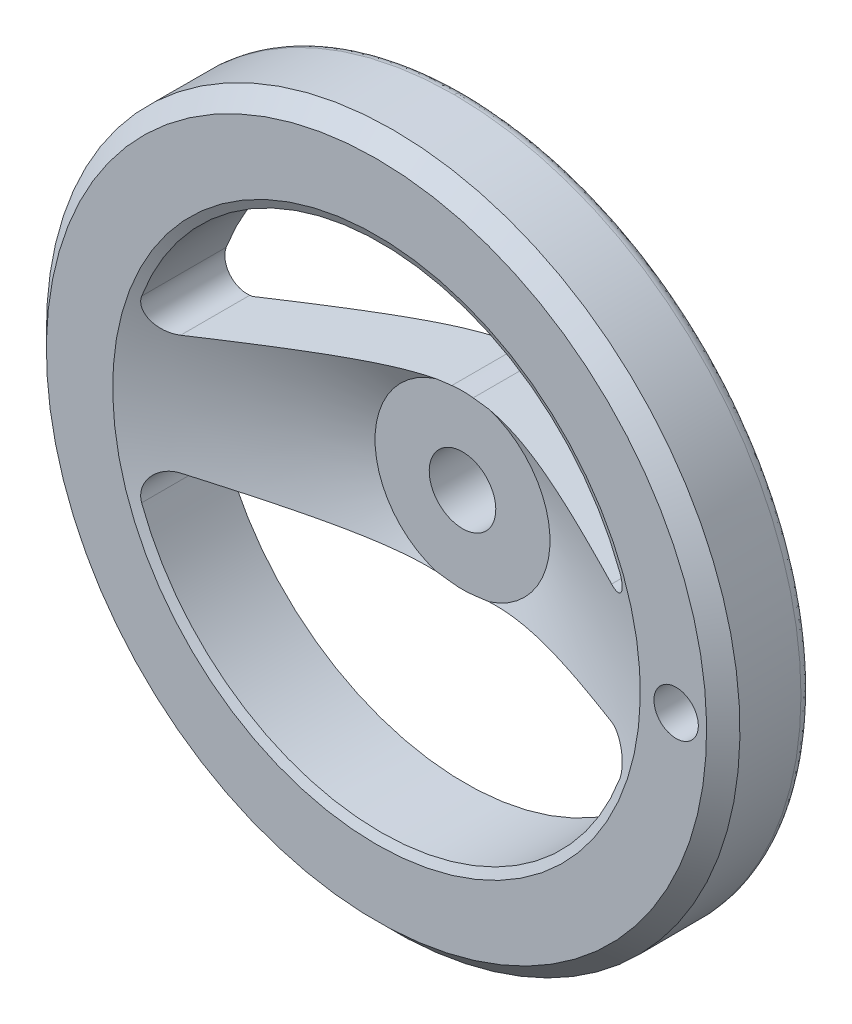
ISO-10303-21;
HEADER;
FILE_DESCRIPTION(('STEP AP214'),'2;1');
FILE_NAME('part.step','',(''),(''),'','','');
FILE_SCHEMA(('AUTOMOTIVE_DESIGN { 1 0 10303 214 1 1 1 1 }'));
ENDSEC;
DATA;
#1=APPLICATION_CONTEXT('core data for automotive mechanical design processes');
#2=APPLICATION_PROTOCOL_DEFINITION('international standard','automotive_design',2000,#1);
#3=PRODUCT_CONTEXT('',#1,'mechanical');
#4=PRODUCT('Part','Part','',(#3));
#5=PRODUCT_RELATED_PRODUCT_CATEGORY('part','',(#4));
#6=PRODUCT_DEFINITION_FORMATION('','',#4);
#7=PRODUCT_DEFINITION_CONTEXT('part definition',#1,'design');
#8=PRODUCT_DEFINITION('design','',#6,#7);
#9=PRODUCT_DEFINITION_SHAPE('','',#8);
#10=(LENGTH_UNIT() NAMED_UNIT(*) SI_UNIT(.MILLI.,.METRE.));
#11=(NAMED_UNIT(*) PLANE_ANGLE_UNIT() SI_UNIT($,.RADIAN.));
#12=(NAMED_UNIT(*) SI_UNIT($,.STERADIAN.) SOLID_ANGLE_UNIT());
#13=UNCERTAINTY_MEASURE_WITH_UNIT(LENGTH_MEASURE(1.E-05),#10,'distance_accuracy_value','');
#14=(GEOMETRIC_REPRESENTATION_CONTEXT(3) GLOBAL_UNCERTAINTY_ASSIGNED_CONTEXT((#13)) GLOBAL_UNIT_ASSIGNED_CONTEXT((#10,
#11,#12)) REPRESENTATION_CONTEXT('',''));
#15=CARTESIAN_POINT('',(0.,0.,0.));
#16=DIRECTION('',(0.,0.,1.));
#17=DIRECTION('',(1.,0.,0.));
#18=AXIS2_PLACEMENT_3D('',#15,#16,#17);
#19=CARTESIAN_POINT('',(0.,0.,33.500545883));
#20=DIRECTION('',(0.,0.,-1.));
#21=DIRECTION('',(0.,1.,0.));
#22=AXIS2_PLACEMENT_3D('',#19,#20,#21);
#23=CONICAL_SURFACE('',#22,59.500260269,0.785398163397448);
#24=CARTESIAN_POINT('',(0.,0.,30.500545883));
#25=DIRECTION('',(0.,0.,-1.));
#26=DIRECTION('',(0.,1.,0.));
#27=AXIS2_PLACEMENT_3D('',#24,#25,#26);
#28=CIRCLE('',#27,62.500260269);
#29=CARTESIAN_POINT('',(0.,62.500260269,30.500545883));
#30=VERTEX_POINT('',#29);
#31=EDGE_CURVE('E140',#30,#30,#28,.T.);
#32=ORIENTED_EDGE('',*,*,#31,.F.);
#33=EDGE_LOOP('',(#32));
#34=FACE_BOUND('',#33,.T.);
#35=CARTESIAN_POINT('',(0.,0.,33.500545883));
#36=DIRECTION('',(0.,0.,-1.));
#37=DIRECTION('',(0.,1.,0.));
#38=AXIS2_PLACEMENT_3D('',#35,#36,#37);
#39=CIRCLE('',#38,59.500260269);
#40=CARTESIAN_POINT('',(0.,59.500260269,33.500545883));
#41=VERTEX_POINT('',#40);
#42=EDGE_CURVE('E544',#41,#41,#39,.T.);
#43=ORIENTED_EDGE('',*,*,#42,.T.);
#44=EDGE_LOOP('',(#43));
#45=FACE_BOUND('',#44,.T.);
#46=ADVANCED_FACE('F14',(#34,#45),#23,.T.);
#47=CARTESIAN_POINT('',(0.,0.,0.));
#48=DIRECTION('',(0.,0.,1.));
#49=DIRECTION('',(0.,-1.,0.));
#50=AXIS2_PLACEMENT_3D('',#47,#48,#49);
#51=CYLINDRICAL_SURFACE('',#50,6.);
#52=CARTESIAN_POINT('',(0.,0.,18.));
#53=DIRECTION('',(0.,0.,1.));
#54=DIRECTION('',(0.,-1.,0.));
#55=AXIS2_PLACEMENT_3D('',#52,#53,#54);
#56=CIRCLE('',#55,6.);
#57=CARTESIAN_POINT('',(0.,-6.,18.));
#58=VERTEX_POINT('',#57);
#59=EDGE_CURVE('E801',#58,#58,#56,.T.);
#60=ORIENTED_EDGE('',*,*,#59,.T.);
#61=EDGE_LOOP('',(#60));
#62=FACE_BOUND('',#61,.T.);
#63=CARTESIAN_POINT('',(0.,0.,0.));
#64=DIRECTION('',(0.,0.,1.));
#65=DIRECTION('',(0.,-1.,0.));
#66=AXIS2_PLACEMENT_3D('',#63,#64,#65);
#67=CIRCLE('',#66,6.);
#68=CARTESIAN_POINT('',(0.,-6.,0.));
#69=VERTEX_POINT('',#68);
#70=EDGE_CURVE('E550',#69,#69,#67,.F.);
#71=ORIENTED_EDGE('',*,*,#70,.T.);
#72=EDGE_LOOP('',(#71));
#73=FACE_BOUND('',#72,.T.);
#74=ADVANCED_FACE('F531',(#62,#73),#51,.F.);
#75=CARTESIAN_POINT('',(0.,0.,30.500545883));
#76=DIRECTION('',(0.,0.,-1.));
#77=DIRECTION('',(-1.,0.,0.));
#78=AXIS2_PLACEMENT_3D('',#75,#76,#77);
#79=CYLINDRICAL_SURFACE('',#78,62.500260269);
#80=CARTESIAN_POINT('',(0.,0.,19.500545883));
#81=DIRECTION('',(0.,0.,-1.));
#82=DIRECTION('',(0.,1.,0.));
#83=AXIS2_PLACEMENT_3D('',#80,#81,#82);
#84=CIRCLE('',#83,62.500260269);
#85=CARTESIAN_POINT('',(-6.40950883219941E-09,-62.500260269,19.500545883));
#86=VERTEX_POINT('',#85);
#87=CARTESIAN_POINT('',(0.,62.500260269,19.500545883));
#88=VERTEX_POINT('',#87);
#89=EDGE_CURVE('E176',#86,#88,#84,.T.);
#90=ORIENTED_EDGE('',*,*,#89,.F.);
#91=CARTESIAN_POINT('',(0.,0.,19.500545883));
#92=DIRECTION('',(0.,0.,-1.));
#93=DIRECTION('',(0.,1.,0.));
#94=AXIS2_PLACEMENT_3D('',#91,#92,#93);
#95=CIRCLE('',#94,62.500260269);
#96=EDGE_CURVE('E179',#88,#86,#95,.T.);
#97=ORIENTED_EDGE('',*,*,#96,.F.);
#98=EDGE_LOOP('',(#90,#97));
#99=FACE_BOUND('',#98,.T.);
#100=ORIENTED_EDGE('',*,*,#31,.T.);
#101=EDGE_LOOP('',(#100));
#102=FACE_BOUND('',#101,.T.);
#103=ADVANCED_FACE('F527',(#99,#102),#79,.T.);
#104=CARTESIAN_POINT('',(0.,0.,5.624368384));
#105=DIRECTION('',(0.,0.,-1.));
#106=DIRECTION('',(0.,1.,0.));
#107=AXIS2_PLACEMENT_3D('',#104,#105,#106);
#108=CYLINDRICAL_SURFACE('',#107,15.50039041);
#109=CARTESIAN_POINT('',(0.,0.,5.62436838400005));
#110=DIRECTION('',(0.,0.,1.));
#111=DIRECTION('',(0.,-1.,0.));
#112=AXIS2_PLACEMENT_3D('',#109,#110,#111);
#113=CIRCLE('',#112,15.50039041);
#114=CARTESIAN_POINT('',(-2.03456691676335,15.36628257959,5.62436838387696));
#115=VERTEX_POINT('',#114);
#116=CARTESIAN_POINT('',(-2.03456691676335,-15.36628257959,5.62436838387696));
#117=VERTEX_POINT('',#116);
#118=EDGE_CURVE('E165',#115,#117,#113,.T.);
#119=ORIENTED_EDGE('',*,*,#118,.F.);
#120=DIRECTION('',(0.,0.,-1.));
#121=VECTOR('',#120,1.);
#122=CARTESIAN_POINT('',(-2.03456688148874,15.366282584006,15.072998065));
#123=LINE('',#122,#121);
#124=CARTESIAN_POINT('',(-2.03456691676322,15.36628257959,0.));
#125=VERTEX_POINT('',#124);
#126=EDGE_CURVE('E164',#115,#125,#123,.T.);
#127=ORIENTED_EDGE('',*,*,#126,.T.);
#128=CARTESIAN_POINT('',(0.,0.,0.));
#129=DIRECTION('',(0.,0.,-1.));
#130=DIRECTION('',(0.,1.,0.));
#131=AXIS2_PLACEMENT_3D('',#128,#129,#130);
#132=CIRCLE('',#131,15.50039041);
#133=CARTESIAN_POINT('',(-2.03456691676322,-15.36628257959,0.));
#134=VERTEX_POINT('',#133);
#135=EDGE_CURVE('E139',#125,#134,#132,.F.);
#136=ORIENTED_EDGE('',*,*,#135,.T.);
#137=DIRECTION('',(0.,0.,1.));
#138=VECTOR('',#137,1.);
#139=CARTESIAN_POINT('',(-2.03456688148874,-15.366282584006,15.072998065));
#140=LINE('',#139,#138);
#141=EDGE_CURVE('E168',#134,#117,#140,.T.);
#142=ORIENTED_EDGE('',*,*,#141,.T.);
#143=EDGE_LOOP('',(#119,#127,#136,#142));
#144=FACE_BOUND('',#143,.T.);
#145=ADVANCED_FACE('F524',(#144),#108,.T.);
#146=CARTESIAN_POINT('',(0.,0.,0.));
#147=DIRECTION('',(0.,0.,1.));
#148=DIRECTION('',(0.,-1.,0.));
#149=AXIS2_PLACEMENT_3D('',#146,#147,#148);
#150=CYLINDRICAL_SURFACE('',#149,15.5);
#151=DIRECTION('',(0.,0.,1.));
#152=VECTOR('',#151,1.);
#153=CARTESIAN_POINT('',(-1.925406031,15.379948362,15.072998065));
#154=LINE('',#153,#152);
#155=CARTESIAN_POINT('',(-1.92540603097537,15.3799483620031,0.));
#156=VERTEX_POINT('',#155);
#157=CARTESIAN_POINT('',(-1.92540603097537,15.3799483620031,17.9999999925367));
#158=VERTEX_POINT('',#157);
#159=EDGE_CURVE('E160',#156,#158,#154,.T.);
#160=ORIENTED_EDGE('',*,*,#159,.T.);
#161=CARTESIAN_POINT('',(0.,0.,18.));
#162=DIRECTION('',(0.,0.,1.));
#163=DIRECTION('',(0.,-1.,0.));
#164=AXIS2_PLACEMENT_3D('',#161,#162,#163);
#165=CIRCLE('',#164,15.5);
#166=CARTESIAN_POINT('',(1.92540603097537,15.3799483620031,17.9999999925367));
#167=VERTEX_POINT('',#166);
#168=EDGE_CURVE('E153',#158,#167,#165,.F.);
#169=ORIENTED_EDGE('',*,*,#168,.T.);
#170=DIRECTION('',(0.,0.,-1.));
#171=VECTOR('',#170,1.);
#172=CARTESIAN_POINT('',(1.925406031,15.379948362,15.072998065));
#173=LINE('',#172,#171);
#174=CARTESIAN_POINT('',(1.92540603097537,15.3799483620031,0.));
#175=VERTEX_POINT('',#174);
#176=EDGE_CURVE('E146',#167,#175,#173,.T.);
#177=ORIENTED_EDGE('',*,*,#176,.T.);
#178=CARTESIAN_POINT('',(0.,0.,0.));
#179=DIRECTION('',(0.,0.,1.));
#180=DIRECTION('',(0.,-1.,0.));
#181=AXIS2_PLACEMENT_3D('',#178,#179,#180);
#182=CIRCLE('',#181,15.5);
#183=EDGE_CURVE('E128',#175,#156,#182,.T.);
#184=ORIENTED_EDGE('',*,*,#183,.T.);
#185=EDGE_LOOP('',(#160,#169,#177,#184));
#186=FACE_BOUND('',#185,.T.);
#187=ADVANCED_FACE('F152',(#186),#150,.T.);
#188=CARTESIAN_POINT('',(0.,0.,5.624368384));
#189=DIRECTION('',(0.,0.,-1.));
#190=DIRECTION('',(0.,1.,0.));
#191=AXIS2_PLACEMENT_3D('',#188,#189,#190);
#192=CYLINDRICAL_SURFACE('',#191,15.50039041);
#193=CARTESIAN_POINT('',(0.,0.,0.));
#194=DIRECTION('',(0.,0.,-1.));
#195=DIRECTION('',(0.,1.,0.));
#196=AXIS2_PLACEMENT_3D('',#193,#194,#195);
#197=CIRCLE('',#196,15.50039041);
#198=CARTESIAN_POINT('',(2.03456691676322,-15.36628257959,0.));
#199=VERTEX_POINT('',#198);
#200=CARTESIAN_POINT('',(2.03456691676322,15.36628257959,0.));
#201=VERTEX_POINT('',#200);
#202=EDGE_CURVE('E556',#199,#201,#197,.F.);
#203=ORIENTED_EDGE('',*,*,#202,.T.);
#204=DIRECTION('',(0.,0.,1.));
#205=VECTOR('',#204,1.);
#206=CARTESIAN_POINT('',(2.03456688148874,15.366282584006,15.072998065));
#207=LINE('',#206,#205);
#208=CARTESIAN_POINT('',(2.03456691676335,15.36628257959,5.62436838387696));
#209=VERTEX_POINT('',#208);
#210=EDGE_CURVE('E150',#201,#209,#207,.T.);
#211=ORIENTED_EDGE('',*,*,#210,.T.);
#212=CARTESIAN_POINT('',(0.,0.,5.62436838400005));
#213=DIRECTION('',(0.,0.,1.));
#214=DIRECTION('',(0.,-1.,0.));
#215=AXIS2_PLACEMENT_3D('',#212,#213,#214);
#216=CIRCLE('',#215,15.50039041);
#217=CARTESIAN_POINT('',(2.03456691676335,-15.36628257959,5.62436838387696));
#218=VERTEX_POINT('',#217);
#219=EDGE_CURVE('E379',#218,#209,#216,.T.);
#220=ORIENTED_EDGE('',*,*,#219,.F.);
#221=DIRECTION('',(0.,0.,-1.));
#222=VECTOR('',#221,1.);
#223=CARTESIAN_POINT('',(2.03456688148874,-15.366282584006,15.072998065));
#224=LINE('',#223,#222);
#225=EDGE_CURVE('E444',#218,#199,#224,.T.);
#226=ORIENTED_EDGE('',*,*,#225,.T.);
#227=EDGE_LOOP('',(#203,#211,#220,#226));
#228=FACE_BOUND('',#227,.T.);
#229=ADVANCED_FACE('F518',(#228),#192,.T.);
#230=CARTESIAN_POINT('',(-15.816654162,15.725633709,0.));
#231=DIRECTION('',(0.,0.,1.));
#232=DIRECTION('',(0.,-1.,0.));
#233=AXIS2_PLACEMENT_3D('',#230,#231,#232);
#234=PLANE('',#233);
#235=ORIENTED_EDGE('',*,*,#70,.F.);
#236=EDGE_LOOP('',(#235));
#237=FACE_BOUND('',#236,.T.);
#238=DIRECTION('',(-0.992254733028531,-0.124219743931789,0.));
#239=VECTOR('',#238,1.);
#240=CARTESIAN_POINT('',(20.3807439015,-13.069536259,0.));
#241=LINE('',#240,#239);
#242=CARTESIAN_POINT('',(1.92540603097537,-15.3799483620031,0.));
#243=VERTEX_POINT('',#242);
#244=EDGE_CURVE('E447',#199,#243,#241,.T.);
#245=ORIENTED_EDGE('',*,*,#244,.T.);
#246=CARTESIAN_POINT('',(0.,0.,0.));
#247=DIRECTION('',(0.,0.,1.));
#248=DIRECTION('',(0.,-1.,0.));
#249=AXIS2_PLACEMENT_3D('',#246,#247,#248);
#250=CIRCLE('',#249,15.5);
#251=CARTESIAN_POINT('',(-1.92540603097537,-15.3799483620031,0.));
#252=VERTEX_POINT('',#251);
#253=EDGE_CURVE('E546',#252,#243,#250,.T.);
#254=ORIENTED_EDGE('',*,*,#253,.F.);
#255=DIRECTION('',(-0.992254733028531,0.124219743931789,0.));
#256=VECTOR('',#255,1.);
#257=CARTESIAN_POINT('',(-20.3807439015,-13.069536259,0.));
#258=LINE('',#257,#256);
#259=EDGE_CURVE('E169',#252,#134,#258,.T.);
#260=ORIENTED_EDGE('',*,*,#259,.T.);
#261=ORIENTED_EDGE('',*,*,#135,.F.);
#262=DIRECTION('',(0.992254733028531,0.124219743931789,0.));
#263=VECTOR('',#262,1.);
#264=CARTESIAN_POINT('',(-20.3807439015,13.069536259,0.));
#265=LINE('',#264,#263);
#266=EDGE_CURVE('E134',#125,#156,#265,.T.);
#267=ORIENTED_EDGE('',*,*,#266,.T.);
#268=ORIENTED_EDGE('',*,*,#183,.F.);
#269=DIRECTION('',(0.992254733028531,-0.124219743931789,0.));
#270=VECTOR('',#269,1.);
#271=CARTESIAN_POINT('',(20.3807439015,13.069536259,0.));
#272=LINE('',#271,#270);
#273=EDGE_CURVE('E132',#175,#201,#272,.T.);
#274=ORIENTED_EDGE('',*,*,#273,.T.);
#275=ORIENTED_EDGE('',*,*,#202,.F.);
#276=EDGE_LOOP('',(#245,#254,#260,#261,#267,#268,#274,#275));
#277=FACE_BOUND('',#276,.T.);
#278=ADVANCED_FACE('F131',(#237,#277),#234,.F.);
#279=CARTESIAN_POINT('',(0.,0.,0.));
#280=DIRECTION('',(0.,0.,1.));
#281=DIRECTION('',(0.,-1.,0.));
#282=AXIS2_PLACEMENT_3D('',#279,#280,#281);
#283=CYLINDRICAL_SURFACE('',#282,15.5);
#284=DIRECTION('',(0.,0.,1.));
#285=VECTOR('',#284,1.);
#286=CARTESIAN_POINT('',(1.925406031,-15.379948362,15.072998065));
#287=LINE('',#286,#285);
#288=CARTESIAN_POINT('',(1.92540603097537,-15.3799483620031,17.9999999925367));
#289=VERTEX_POINT('',#288);
#290=EDGE_CURVE('E443',#243,#289,#287,.T.);
#291=ORIENTED_EDGE('',*,*,#290,.T.);
#292=CARTESIAN_POINT('',(0.,0.,18.));
#293=DIRECTION('',(0.,0.,1.));
#294=DIRECTION('',(0.,-1.,0.));
#295=AXIS2_PLACEMENT_3D('',#292,#293,#294);
#296=CIRCLE('',#295,15.5);
#297=CARTESIAN_POINT('',(-1.92540603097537,-15.3799483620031,17.9999999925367));
#298=VERTEX_POINT('',#297);
#299=EDGE_CURVE('E548',#289,#298,#296,.F.);
#300=ORIENTED_EDGE('',*,*,#299,.T.);
#301=DIRECTION('',(0.,0.,-1.));
#302=VECTOR('',#301,1.);
#303=CARTESIAN_POINT('',(-1.925406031,-15.379948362,15.072998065));
#304=LINE('',#303,#302);
#305=EDGE_CURVE('E172',#298,#252,#304,.T.);
#306=ORIENTED_EDGE('',*,*,#305,.T.);
#307=ORIENTED_EDGE('',*,*,#253,.T.);
#308=EDGE_LOOP('',(#291,#300,#306,#307));
#309=FACE_BOUND('',#308,.T.);
#310=ADVANCED_FACE('F508',(#309),#283,.T.);
#311=CARTESIAN_POINT('',(-60.42145883,-60.214263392,33.500545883));
#312=DIRECTION('',(0.,0.,-1.));
#313=DIRECTION('',(0.,1.,0.));
#314=AXIS2_PLACEMENT_3D('',#311,#312,#313);
#315=PLANE('',#314);
#316=CARTESIAN_POINT('',(54.,0.,33.500545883));
#317=DIRECTION('',(0.,0.,1.));
#318=DIRECTION('',(0.,-1.,0.));
#319=AXIS2_PLACEMENT_3D('',#316,#317,#318);
#320=CIRCLE('',#319,4.);
#321=CARTESIAN_POINT('',(54.,-4.,33.500545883));
#322=VERTEX_POINT('',#321);
#323=EDGE_CURVE('E794',#322,#322,#320,.T.);
#324=ORIENTED_EDGE('',*,*,#323,.F.);
#325=EDGE_LOOP('',(#324));
#326=FACE_BOUND('',#325,.T.);
#327=CARTESIAN_POINT('',(0.,0.,33.500545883));
#328=DIRECTION('',(0.,0.,1.));
#329=DIRECTION('',(0.,-1.,0.));
#330=AXIS2_PLACEMENT_3D('',#327,#328,#329);
#331=CIRCLE('',#330,47.545368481);
#332=CARTESIAN_POINT('',(0.,-47.545368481,33.500545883));
#333=VERTEX_POINT('',#332);
#334=EDGE_CURVE('E453',#333,#333,#331,.F.);
#335=ORIENTED_EDGE('',*,*,#334,.T.);
#336=EDGE_LOOP('',(#335));
#337=FACE_BOUND('',#336,.T.);
#338=ORIENTED_EDGE('',*,*,#42,.F.);
#339=EDGE_LOOP('',(#338));
#340=FACE_BOUND('',#339,.T.);
#341=ADVANCED_FACE('F516',(#326,#337,#340),#315,.F.);
#342=CARTESIAN_POINT('',(-16.054874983,-15.686236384,18.));
#343=DIRECTION('',(0.,0.,-1.));
#344=DIRECTION('',(0.,1.,0.));
#345=AXIS2_PLACEMENT_3D('',#342,#343,#344);
#346=PLANE('',#345);
#347=ORIENTED_EDGE('',*,*,#59,.F.);
#348=EDGE_LOOP('',(#347));
#349=FACE_BOUND('',#348,.T.);
#350=ORIENTED_EDGE('',*,*,#299,.F.);
#351=DIRECTION('',(0.992254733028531,0.124219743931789,0.));
#352=VECTOR('',#351,1.);
#353=CARTESIAN_POINT('',(20.3807439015,-13.069536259,17.9999999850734));
#354=LINE('',#353,#352);
#355=CARTESIAN_POINT('',(4.77901605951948,-15.0227067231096,17.9999999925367));
#356=VERTEX_POINT('',#355);
#357=EDGE_CURVE('E439',#289,#356,#354,.T.);
#358=ORIENTED_EDGE('',*,*,#357,.T.);
#359=CARTESIAN_POINT('',(0.,0.,18.));
#360=DIRECTION('',(0.,0.,1.));
#361=DIRECTION('',(0.,-1.,0.));
#362=AXIS2_PLACEMENT_3D('',#359,#360,#361);
#363=CIRCLE('',#362,15.76453971);
#364=CARTESIAN_POINT('',(4.77901605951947,15.0227067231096,17.9999999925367));
#365=VERTEX_POINT('',#364);
#366=EDGE_CURVE('E603',#356,#365,#363,.T.);
#367=ORIENTED_EDGE('',*,*,#366,.T.);
#368=DIRECTION('',(-0.992254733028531,0.124219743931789,0.));
#369=VECTOR('',#368,1.);
#370=CARTESIAN_POINT('',(20.3807439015,13.069536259,17.9999999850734));
#371=LINE('',#370,#369);
#372=EDGE_CURVE('E154',#365,#167,#371,.T.);
#373=ORIENTED_EDGE('',*,*,#372,.T.);
#374=ORIENTED_EDGE('',*,*,#168,.F.);
#375=DIRECTION('',(-0.992254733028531,-0.124219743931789,0.));
#376=VECTOR('',#375,1.);
#377=CARTESIAN_POINT('',(-20.3807439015,13.069536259,17.9999999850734));
#378=LINE('',#377,#376);
#379=CARTESIAN_POINT('',(-4.77901614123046,15.0227067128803,17.9999999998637));
#380=VERTEX_POINT('',#379);
#381=EDGE_CURVE('E162',#158,#380,#378,.T.);
#382=ORIENTED_EDGE('',*,*,#381,.T.);
#383=CARTESIAN_POINT('',(0.,0.,18.));
#384=DIRECTION('',(0.,0.,1.));
#385=DIRECTION('',(0.,-1.,0.));
#386=AXIS2_PLACEMENT_3D('',#383,#384,#385);
#387=CIRCLE('',#386,15.76453971);
#388=CARTESIAN_POINT('',(-4.77901605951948,-15.0227067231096,17.9999999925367));
#389=VERTEX_POINT('',#388);
#390=EDGE_CURVE('E180',#380,#389,#387,.T.);
#391=ORIENTED_EDGE('',*,*,#390,.T.);
#392=DIRECTION('',(0.992254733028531,-0.124219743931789,0.));
#393=VECTOR('',#392,1.);
#394=CARTESIAN_POINT('',(-20.3807439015,-13.069536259,17.9999999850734));
#395=LINE('',#394,#393);
#396=EDGE_CURVE('E175',#389,#298,#395,.T.);
#397=ORIENTED_EDGE('',*,*,#396,.T.);
#398=EDGE_LOOP('',(#350,#358,#367,#373,#374,#382,#391,#397));
#399=FACE_BOUND('',#398,.T.);
#400=ADVANCED_FACE('F359',(#349,#399),#346,.F.);
#401=CARTESIAN_POINT('',(0.,-60.50039041,17.500212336));
#402=CARTESIAN_POINT('',(-121.000780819,-60.50039041,17.500212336));
#403=CARTESIAN_POINT('',(-121.000780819,60.50039041,17.500212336));
#404=CARTESIAN_POINT('',(0.,60.50039041,17.500212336));
#405=CARTESIAN_POINT('',(0.,-61.672057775,17.50028856));
#406=CARTESIAN_POINT('',(-123.34411555,-61.672057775,17.50028856));
#407=CARTESIAN_POINT('',(-123.34411555,61.672057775,17.50028856));
#408=CARTESIAN_POINT('',(0.,61.672057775,17.50028856));
#409=CARTESIAN_POINT('',(0.,-62.500455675,18.328878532));
#410=CARTESIAN_POINT('',(-125.000911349,-62.500455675,18.328878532));
#411=CARTESIAN_POINT('',(-125.000911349,62.500455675,18.328878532));
#412=CARTESIAN_POINT('',(0.,62.500455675,18.328878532));
#413=CARTESIAN_POINT('',(0.,-62.500260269,19.500545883));
#414=CARTESIAN_POINT('',(-125.000520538,-62.500260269,19.500545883));
#415=CARTESIAN_POINT('',(-125.000520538,62.500260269,19.500545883));
#416=CARTESIAN_POINT('',(0.,62.500260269,19.500545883));
#417=(BOUNDED_SURFACE() B_SPLINE_SURFACE(3,3,((#401,#402,#403,#404),(#405,#406,#407,#408),(#409,
#410,#411,#412),(#413,#414,#415,#416)),.UNSPECIFIED.,.F.,.F.,
.F.) B_SPLINE_SURFACE_WITH_KNOTS((4,4),(4,4),(0.,1.),(0.,1.),
.UNSPECIFIED.) GEOMETRIC_REPRESENTATION_ITEM() RATIONAL_B_SPLINE_SURFACE(((1.,0.333333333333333,
0.333333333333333,1.),(0.804713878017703,0.268237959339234,0.268237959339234,0.804713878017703),
(0.804713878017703,0.268237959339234,0.268237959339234,0.804713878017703),(1.,0.333333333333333,
0.333333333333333,1.))) REPRESENTATION_ITEM('') SURFACE());
#418=CARTESIAN_POINT('',(0.,60.50039041,17.500212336));
#419=CARTESIAN_POINT('',(0.,61.672057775,17.50028856));
#420=CARTESIAN_POINT('',(0.,62.500455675,18.328878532));
#421=CARTESIAN_POINT('',(0.,62.500260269,19.500545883));
#422=(BOUNDED_CURVE() B_SPLINE_CURVE(3,(#418,#419,#420,#421),.UNSPECIFIED.,.F.,
.F.) B_SPLINE_CURVE_WITH_KNOTS((4,4),(0.,1.),
.UNSPECIFIED.) CURVE() GEOMETRIC_REPRESENTATION_ITEM() RATIONAL_B_SPLINE_CURVE((1.,
0.804713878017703,0.804713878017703,1.)) REPRESENTATION_ITEM(''));
#423=CARTESIAN_POINT('',(0.,60.5003903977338,17.500212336));
#424=VERTEX_POINT('',#423);
#425=EDGE_CURVE('E324',#424,#88,#422,.T.);
#426=CARTESIAN_POINT('',(0.,60.5003904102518,17.500212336));
#427=CARTESIAN_POINT('',(-121.000780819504,60.5003904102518,17.500212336));
#428=CARTESIAN_POINT('',(-121.000780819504,-60.5003904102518,17.500212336));
#429=CARTESIAN_POINT('',(0.,-60.5003904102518,17.500212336));
#430=(BOUNDED_CURVE() B_SPLINE_CURVE(3,(#426,#427,#428,#429),.UNSPECIFIED.,.F.,
.F.) B_SPLINE_CURVE_WITH_KNOTS((4,4),(0.,1.),
.UNSPECIFIED.) CURVE() GEOMETRIC_REPRESENTATION_ITEM() RATIONAL_B_SPLINE_CURVE((0.999999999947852,
0.33333333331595,0.33333333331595,0.999999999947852)) REPRESENTATION_ITEM(''));
#431=CARTESIAN_POINT('',(0.,-60.5003903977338,17.500212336));
#432=VERTEX_POINT('',#431);
#433=EDGE_CURVE('E191',#424,#432,#430,.T.);
#434=CARTESIAN_POINT('',(0.,-60.50039041,17.500212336));
#435=CARTESIAN_POINT('',(0.,-61.672057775,17.50028856));
#436=CARTESIAN_POINT('',(0.,-62.500455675,18.328878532));
#437=CARTESIAN_POINT('',(0.,-62.500260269,19.500545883));
#438=(BOUNDED_CURVE() B_SPLINE_CURVE(3,(#434,#435,#436,#437),.UNSPECIFIED.,.F.,
.F.) B_SPLINE_CURVE_WITH_KNOTS((4,4),(0.,1.),
.UNSPECIFIED.) CURVE() GEOMETRIC_REPRESENTATION_ITEM() RATIONAL_B_SPLINE_CURVE((1.,
0.804713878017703,0.804713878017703,1.)) REPRESENTATION_ITEM(''));
#439=EDGE_CURVE('E183',#86,#432,#438,.F.);
#440=ORIENTED_EDGE('',*,*,#425,.F.);
#441=ORIENTED_EDGE('',*,*,#433,.T.);
#442=ORIENTED_EDGE('',*,*,#439,.F.);
#443=ORIENTED_EDGE('',*,*,#89,.T.);
#444=EDGE_LOOP('',(#440,#441,#442,#443));
#445=FACE_BOUND('',#444,.T.);
#446=ADVANCED_FACE('F497',(#445),#417,.T.);
#447=CARTESIAN_POINT('',(0.,60.50039041,17.500212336));
#448=CARTESIAN_POINT('',(121.000780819,60.50039041,17.500212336));
#449=CARTESIAN_POINT('',(121.000780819,-60.50039041,17.500212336));
#450=CARTESIAN_POINT('',(0.,-60.50039041,17.500212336));
#451=CARTESIAN_POINT('',(0.,61.672057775,17.50028856));
#452=CARTESIAN_POINT('',(123.34411555,61.672057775,17.50028856));
#453=CARTESIAN_POINT('',(123.34411555,-61.672057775,17.50028856));
#454=CARTESIAN_POINT('',(0.,-61.672057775,17.50028856));
#455=CARTESIAN_POINT('',(0.,62.500455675,18.328878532));
#456=CARTESIAN_POINT('',(125.000911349,62.500455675,18.328878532));
#457=CARTESIAN_POINT('',(125.000911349,-62.500455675,18.328878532));
#458=CARTESIAN_POINT('',(0.,-62.500455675,18.328878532));
#459=CARTESIAN_POINT('',(0.,62.500260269,19.500545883));
#460=CARTESIAN_POINT('',(125.000520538,62.500260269,19.500545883));
#461=CARTESIAN_POINT('',(125.000520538,-62.500260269,19.500545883));
#462=CARTESIAN_POINT('',(0.,-62.500260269,19.500545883));
#463=(BOUNDED_SURFACE() B_SPLINE_SURFACE(3,3,((#447,#448,#449,#450),(#451,#452,#453,#454),(#455,
#456,#457,#458),(#459,#460,#461,#462)),.UNSPECIFIED.,.F.,.F.,
.F.) B_SPLINE_SURFACE_WITH_KNOTS((4,4),(4,4),(0.,1.),(0.,1.),
.UNSPECIFIED.) GEOMETRIC_REPRESENTATION_ITEM() RATIONAL_B_SPLINE_SURFACE(((1.,0.333333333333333,
0.333333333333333,1.),(0.804713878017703,0.268237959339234,0.268237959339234,0.804713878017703),
(0.804713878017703,0.268237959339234,0.268237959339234,0.804713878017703),(1.,0.333333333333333,
0.333333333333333,1.))) REPRESENTATION_ITEM('') SURFACE());
#464=CARTESIAN_POINT('',(0.,-60.5003904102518,17.500212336));
#465=CARTESIAN_POINT('',(121.000780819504,-60.5003904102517,17.500212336));
#466=CARTESIAN_POINT('',(121.000780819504,60.5003904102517,17.500212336));
#467=CARTESIAN_POINT('',(0.,60.5003904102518,17.500212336));
#468=(BOUNDED_CURVE() B_SPLINE_CURVE(3,(#464,#465,#466,#467),.UNSPECIFIED.,.F.,
.F.) B_SPLINE_CURVE_WITH_KNOTS((4,4),(0.,1.),
.UNSPECIFIED.) CURVE() GEOMETRIC_REPRESENTATION_ITEM() RATIONAL_B_SPLINE_CURVE((0.999999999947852,
0.33333333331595,0.33333333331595,0.999999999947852)) REPRESENTATION_ITEM(''));
#469=EDGE_CURVE('E204',#432,#424,#468,.T.);
#470=ORIENTED_EDGE('',*,*,#469,.T.);
#471=ORIENTED_EDGE('',*,*,#425,.T.);
#472=ORIENTED_EDGE('',*,*,#96,.T.);
#473=ORIENTED_EDGE('',*,*,#439,.T.);
#474=EDGE_LOOP('',(#470,#471,#472,#473));
#475=FACE_BOUND('',#474,.T.);
#476=ADVANCED_FACE('F332',(#475),#463,.T.);
#477=CARTESIAN_POINT('',(-39.332960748,-14.728143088,17.500212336));
#478=DIRECTION('',(0.,0.,1.));
#479=DIRECTION('',(1.,0.,0.));
#480=AXIS2_PLACEMENT_3D('',#477,#478,#479);
#481=CYLINDRICAL_SURFACE('',#480,4.);
#482=CARTESIAN_POINT('',(-43.078957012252,-16.1308233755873,32.7468193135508));
#483=CARTESIAN_POINT('',(-43.1159187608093,-16.0321599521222,32.7468256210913));
#484=CARTESIAN_POINT('',(-43.1489503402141,-15.9320304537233,32.7449658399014));
#485=CARTESIAN_POINT('',(-43.2069865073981,-15.7296273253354,32.7375606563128));
#486=CARTESIAN_POINT('',(-43.2319928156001,-15.6273541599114,32.7320160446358));
#487=CARTESIAN_POINT('',(-43.2737667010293,-15.4217094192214,32.7173092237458));
#488=CARTESIAN_POINT('',(-43.2905581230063,-15.3183419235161,32.7081576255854));
#489=CARTESIAN_POINT('',(-43.3159680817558,-15.1109791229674,32.6863245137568));
#490=CARTESIAN_POINT('',(-43.3245864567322,-15.0069838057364,32.6736429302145));
#491=CARTESIAN_POINT('',(-43.3336811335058,-14.7991650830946,32.6448703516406));
#492=CARTESIAN_POINT('',(-43.3341619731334,-14.6953416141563,32.628781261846));
#493=CARTESIAN_POINT('',(-43.327119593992,-14.4885159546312,32.5933317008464));
#494=CARTESIAN_POINT('',(-43.3195934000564,-14.3855140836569,32.573970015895));
#495=CARTESIAN_POINT('',(-43.2852480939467,-14.0787872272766,32.5112058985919));
#496=CARTESIAN_POINT('',(-43.2466676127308,-13.8772085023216,32.4631059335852));
#497=CARTESIAN_POINT('',(-43.1385760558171,-13.4785739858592,32.3541373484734));
#498=CARTESIAN_POINT('',(-43.0680751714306,-13.2818939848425,32.2928959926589));
#499=CARTESIAN_POINT('',(-42.8990932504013,-12.9045614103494,32.1604274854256));
#500=CARTESIAN_POINT('',(-42.8006022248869,-12.7239145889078,32.0891967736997));
#501=CARTESIAN_POINT('',(-42.5700591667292,-12.3681143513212,31.932364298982));
#502=CARTESIAN_POINT('',(-42.4359179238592,-12.1946249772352,31.8460631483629));
#503=CARTESIAN_POINT('',(-42.1435922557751,-11.8737609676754,31.6660976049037));
#504=CARTESIAN_POINT('',(-41.985402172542,-11.7263924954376,31.5724314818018));
#505=CARTESIAN_POINT('',(-41.6344460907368,-11.4482558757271,31.3712380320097));
#506=CARTESIAN_POINT('',(-41.4398539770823,-11.3201451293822,31.2632198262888));
#507=CARTESIAN_POINT('',(-41.0329326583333,-11.0999646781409,31.0435304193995));
#508=CARTESIAN_POINT('',(-40.8205872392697,-11.0079283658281,30.9318559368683));
#509=CARTESIAN_POINT('',(-40.3688048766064,-10.8567606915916,30.699913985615));
#510=CARTESIAN_POINT('',(-40.1285079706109,-10.800301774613,30.579579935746));
#511=CARTESIAN_POINT('',(-39.6408304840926,-10.7324453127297,30.3413175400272));
#512=CARTESIAN_POINT('',(-39.3934658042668,-10.7209535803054,30.22338468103));
#513=CARTESIAN_POINT('',(-39.094438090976,-10.7349236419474,30.0845323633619));
#514=CARTESIAN_POINT('',(-39.0427000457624,-10.7383498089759,30.0606424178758));
#515=CARTESIAN_POINT('',(-38.9393233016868,-10.7472222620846,30.0131827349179));
#516=CARTESIAN_POINT('',(-38.8876845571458,-10.7526662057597,29.9896126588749));
#517=CARTESIAN_POINT('',(-38.8360817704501,-10.759124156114,29.9661989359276));
#518=B_SPLINE_CURVE_WITH_KNOTS('',3,(#482,#483,#484,#485,#486,#487,#488,#489,#490,#491,#492,
#493,#494,#495,#496,#497,#498,#499,#500,#501,#502,#503,#504,#505,#506,#507,#508,#509,#510,#511,
#512,#513,#514,#515,#516,#517),.UNSPECIFIED.,.F.,.F.,(4,2,2,2,2,2,2,2,2,2,2,2,2,2,2,2,2,4),(0.,
0.315971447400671,0.631875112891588,0.946856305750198,1.26184373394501,1.57665550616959,
1.89158429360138,2.52104504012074,3.17152457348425,3.82223653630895,4.52628674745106,
5.2305028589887,5.99760224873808,6.76541004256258,7.58558645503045,8.40404401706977,
8.57529578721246,8.74634937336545),.UNSPECIFIED.);
#519=CARTESIAN_POINT('',(-43.078957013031,-16.1308233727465,32.7468193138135));
#520=VERTEX_POINT('',#519);
#521=CARTESIAN_POINT('',(-38.8360817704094,-10.7591241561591,29.9661989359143));
#522=VERTEX_POINT('',#521);
#523=EDGE_CURVE('E316',#520,#522,#518,.T.);
#524=ORIENTED_EDGE('',*,*,#523,.F.);
#525=DIRECTION('',(0.,0.,-1.));
#526=VECTOR('',#525,1.);
#527=CARTESIAN_POINT('',(-43.0789570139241,-16.1308233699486,25.123515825));
#528=LINE('',#527,#526);
#529=CARTESIAN_POINT('',(-43.0789570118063,-16.130823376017,17.500212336));
#530=VERTEX_POINT('',#529);
#531=EDGE_CURVE('E407',#520,#530,#528,.T.);
#532=ORIENTED_EDGE('',*,*,#531,.T.);
#533=CARTESIAN_POINT('',(-39.332960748,-14.728143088,17.500212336));
#534=DIRECTION('',(0.,0.,1.));
#535=DIRECTION('',(1.,0.,0.));
#536=AXIS2_PLACEMENT_3D('',#533,#534,#535);
#537=CIRCLE('',#536,4.);
#538=CARTESIAN_POINT('',(-38.8360817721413,-10.7591241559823,17.500212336));
#539=VERTEX_POINT('',#538);
#540=EDGE_CURVE('E244',#530,#539,#537,.F.);
#541=ORIENTED_EDGE('',*,*,#540,.T.);
#542=DIRECTION('',(0.,0.,1.));
#543=VECTOR('',#542,1.);
#544=CARTESIAN_POINT('',(-38.836081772,-10.759124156,15.072998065));
#545=LINE('',#544,#543);
#546=EDGE_CURVE('E323',#539,#522,#545,.T.);
#547=ORIENTED_EDGE('',*,*,#546,.T.);
#548=EDGE_LOOP('',(#524,#532,#541,#547));
#549=FACE_BOUND('',#548,.T.);
#550=ADVANCED_FACE('F326',(#549),#481,.F.);
#551=CARTESIAN_POINT('',(-1.925406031,-15.379948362,0.));
#552=DIRECTION('',(0.124219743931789,0.992254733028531,0.));
#553=DIRECTION('',(-0.992254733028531,0.124219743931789,0.));
#554=AXIS2_PLACEMENT_3D('',#551,#552,#553);
#555=PLANE('',#554);
#556=ORIENTED_EDGE('',*,*,#141,.F.);
#557=ORIENTED_EDGE('',*,*,#259,.F.);
#558=ORIENTED_EDGE('',*,*,#305,.F.);
#559=ORIENTED_EDGE('',*,*,#396,.F.);
#560=CARTESIAN_POINT('',(-38.8360817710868,-10.7591241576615,29.9661989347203));
#561=CARTESIAN_POINT('',(-38.1490683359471,-10.8451309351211,29.6544988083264));
#562=CARTESIAN_POINT('',(-37.4615868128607,-10.9311963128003,29.3438424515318));
#563=CARTESIAN_POINT('',(-36.0855128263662,-11.1034661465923,28.725025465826));
#564=CARTESIAN_POINT('',(-35.3969203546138,-11.1896706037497,28.4168648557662));
#565=CARTESIAN_POINT('',(-34.0187393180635,-11.3622042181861,27.803576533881));
#566=CARTESIAN_POINT('',(-33.3291512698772,-11.4485333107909,27.4984476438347));
#567=CARTESIAN_POINT('',(-31.9484877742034,-11.6213777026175,26.891626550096));
#568=CARTESIAN_POINT('',(-31.2574123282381,-11.7078930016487,26.5899343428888));
#569=CARTESIAN_POINT('',(-29.8767443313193,-11.8807379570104,25.9920372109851));
#570=CARTESIAN_POINT('',(-29.1871599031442,-11.9670665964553,25.6958132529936));
#571=CARTESIAN_POINT('',(-27.8059550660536,-12.1399787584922,25.1082277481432));
#572=CARTESIAN_POINT('',(-27.1143346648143,-12.226562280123,24.8168661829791));
#573=CARTESIAN_POINT('',(-25.7283180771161,-12.4000768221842,24.2398801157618));
#574=CARTESIAN_POINT('',(-25.0339206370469,-12.4870079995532,23.9542586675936));
#575=CARTESIAN_POINT('',(-23.6422381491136,-12.6612318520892,23.3902196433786));
#576=CARTESIAN_POINT('',(-22.9449530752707,-12.7485245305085,23.1118021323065));
#577=CARTESIAN_POINT('',(-21.5423223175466,-12.9241189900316,22.5620586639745));
#578=CARTESIAN_POINT('',(-20.8369538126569,-13.012423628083,22.2907916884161));
#579=CARTESIAN_POINT('',(-19.4220528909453,-13.1895541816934,21.7595315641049));
#580=CARTESIAN_POINT('',(-18.7125205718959,-13.2783800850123,21.4995381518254));
#581=CARTESIAN_POINT('',(-17.2893429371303,-13.4565467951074,20.994072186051));
#582=CARTESIAN_POINT('',(-16.5757037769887,-13.5458868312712,20.7485821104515));
#583=CARTESIAN_POINT('',(-15.1424543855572,-13.7253144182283,20.2755771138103));
#584=CARTESIAN_POINT('',(-14.42284349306,-13.8154020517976,20.0480642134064));
#585=CARTESIAN_POINT('',(-12.9728426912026,-13.996926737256,19.6148045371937));
#586=CARTESIAN_POINT('',(-12.2424152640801,-14.0883684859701,19.4091843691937));
#587=CARTESIAN_POINT('',(-10.7741307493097,-14.2721820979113,19.0275329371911));
#588=CARTESIAN_POINT('',(-10.0362764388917,-14.3645536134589,18.8514910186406));
#589=CARTESIAN_POINT('',(-8.92212373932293,-14.5040336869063,18.6148565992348));
#590=CARTESIAN_POINT('',(-8.5487040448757,-14.5507818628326,18.5404202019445));
#591=CARTESIAN_POINT('',(-7.79998807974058,-14.6445131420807,18.4018875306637));
#592=CARTESIAN_POINT('',(-7.42469190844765,-14.6914962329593,18.3377907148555));
#593=CARTESIAN_POINT('',(-6.6718825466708,-14.78573996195,18.2208526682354));
#594=CARTESIAN_POINT('',(-6.29436716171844,-14.8330008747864,18.1680256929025));
#595=CARTESIAN_POINT('',(-5.53777680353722,-14.9277179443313,18.0746077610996));
#596=CARTESIAN_POINT('',(-5.15870153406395,-14.9751741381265,18.0340192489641));
#597=CARTESIAN_POINT('',(-4.77901614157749,-15.0227067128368,17.9999999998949));
#598=B_SPLINE_CURVE_WITH_KNOTS('',3,(#560,#561,#562,#563,#564,#565,#566,#567,#568,#569,#570,
#571,#572,#573,#574,#575,#576,#577,#578,#579,#580,#581,#582,#583,#584,#585,#586,#587,#588,#589,
#590,#591,#592,#593,#594,#595,#596,#597),.UNSPECIFIED.,.F.,.F.,(4,2,2,2,2,2,2,2,2,2,2,2,2,2,2,2,
2,2,4),(0.,2.27791173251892,4.55584065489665,6.83284665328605,9.109850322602,11.3762312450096,
13.6426036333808,15.9101514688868,18.1777197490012,20.4602644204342,22.742755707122,
25.022430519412,27.3023612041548,29.5948326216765,31.8864764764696,33.0372333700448,
34.187929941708,35.3400735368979,36.4924470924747),.UNSPECIFIED.);
#599=EDGE_CURVE('E307',#522,#389,#598,.T.);
#600=ORIENTED_EDGE('',*,*,#599,.F.);
#601=ORIENTED_EDGE('',*,*,#546,.F.);
#602=DIRECTION('',(-0.992254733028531,0.124219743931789,0.));
#603=VECTOR('',#602,1.);
#604=CARTESIAN_POINT('',(-1.925406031,-15.379948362,17.500212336));
#605=LINE('',#604,#603);
#606=CARTESIAN_POINT('',(-38.3525215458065,-10.8196607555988,17.5002123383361));
#607=VERTEX_POINT('',#606);
#608=EDGE_CURVE('E241',#539,#607,#605,.F.);
#609=ORIENTED_EDGE('',*,*,#608,.T.);
#610=CARTESIAN_POINT('',(-2.03456689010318,-15.3662825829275,5.62436838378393));
#611=CARTESIAN_POINT('',(-2.2942508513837,-15.333772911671,5.62526313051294));
#612=CARTESIAN_POINT('',(-2.55392103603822,-15.3012649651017,5.62941257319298));
#613=CARTESIAN_POINT('',(-3.07307306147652,-15.2362726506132,5.64412924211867));
#614=CARTESIAN_POINT('',(-3.33255490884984,-15.2037882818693,5.65469623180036));
#615=CARTESIAN_POINT('',(-3.85106806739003,-15.1388759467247,5.68215008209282));
#616=CARTESIAN_POINT('',(-4.11009953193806,-15.1064479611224,5.69903400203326));
#617=CARTESIAN_POINT('',(-4.62769179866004,-15.0416509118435,5.73895312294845));
#618=CARTESIAN_POINT('',(-4.88625259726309,-15.0092818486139,5.76198837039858));
#619=CARTESIAN_POINT('',(-5.65907798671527,-14.9125323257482,5.83981729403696));
#620=CARTESIAN_POINT('',(-6.1724877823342,-14.8482588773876,5.9034432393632));
#621=CARTESIAN_POINT('',(-7.19624045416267,-14.7200959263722,6.05218507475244));
#622=CARTESIAN_POINT('',(-7.70658296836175,-14.6562064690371,6.13730345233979));
#623=CARTESIAN_POINT('',(-8.72004563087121,-14.5293317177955,6.32586820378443));
#624=CARTESIAN_POINT('',(-9.22319130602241,-14.4663432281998,6.42917622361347));
#625=CARTESIAN_POINT('',(-10.2258785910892,-14.3408174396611,6.65208061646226));
#626=CARTESIAN_POINT('',(-10.7254202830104,-14.2782801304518,6.7716766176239));
#627=CARTESIAN_POINT('',(-11.7215177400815,-14.1535793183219,7.02498133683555));
#628=CARTESIAN_POINT('',(-12.2180697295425,-14.0914162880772,7.15870504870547));
#629=CARTESIAN_POINT('',(-13.2078467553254,-13.9675067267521,7.43807785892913));
#630=CARTESIAN_POINT('',(-13.7010717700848,-13.9057601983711,7.58372703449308));
#631=CARTESIAN_POINT('',(-14.7077151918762,-13.7797391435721,7.89226724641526));
#632=CARTESIAN_POINT('',(-15.2209853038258,-13.7154831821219,8.05564795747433));
#633=CARTESIAN_POINT('',(-16.2445171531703,-13.5873478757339,8.39174319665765));
#634=CARTESIAN_POINT('',(-16.7547787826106,-13.5234685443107,8.56445805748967));
#635=CARTESIAN_POINT('',(-17.7726779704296,-13.396038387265,8.9177705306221));
#636=CARTESIAN_POINT('',(-18.2803151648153,-13.3324876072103,9.09836920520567));
#637=CARTESIAN_POINT('',(-19.2932030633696,-13.2056848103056,9.46620811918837));
#638=CARTESIAN_POINT('',(-19.798453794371,-13.1424327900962,9.65344828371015));
#639=CARTESIAN_POINT('',(-20.8070545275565,-13.0161667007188,10.0336388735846));
#640=CARTESIAN_POINT('',(-21.3104037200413,-12.9531527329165,10.2265914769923));
#641=CARTESIAN_POINT('',(-22.3152599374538,-12.827355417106,10.6173136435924));
#642=CARTESIAN_POINT('',(-22.816766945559,-12.7645720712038,10.8150832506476));
#643=CARTESIAN_POINT('',(-24.318780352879,-12.5765359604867,11.4145193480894));
#644=CARTESIAN_POINT('',(-25.3168667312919,-12.4515861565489,11.8223464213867));
#645=CARTESIAN_POINT('',(-27.3244632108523,-12.2002564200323,12.6570451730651));
#646=CARTESIAN_POINT('',(-28.3338896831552,-12.0738869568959,13.0841201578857));
#647=CARTESIAN_POINT('',(-30.3487191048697,-11.8216517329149,13.9478617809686));
#648=CARTESIAN_POINT('',(-31.3541219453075,-11.6957859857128,14.3845286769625));
#649=CARTESIAN_POINT('',(-33.359833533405,-11.4446922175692,15.2644338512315));
#650=CARTESIAN_POINT('',(-34.3601483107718,-11.3194634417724,15.7076581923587));
#651=CARTESIAN_POINT('',(-35.8586720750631,-11.1318641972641,16.3768383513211));
#652=CARTESIAN_POINT('',(-36.3578407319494,-11.0693735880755,16.600615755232));
#653=CARTESIAN_POINT('',(-37.355599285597,-10.9444648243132,17.0494736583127));
#654=CARTESIAN_POINT('',(-37.8541891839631,-10.8820466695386,17.2745541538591));
#655=CARTESIAN_POINT('',(-38.3525215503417,-10.819660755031,17.5002123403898));
#656=B_SPLINE_CURVE_WITH_KNOTS('',3,(#610,#611,#612,#613,#614,#615,#616,#617,#618,#619,#620,
#621,#622,#623,#624,#625,#626,#627,#628,#629,#630,#631,#632,#633,#634,#635,#636,#637,#638,#639,
#640,#641,#642,#643,#644,#645,#646,#647,#648,#649,#650,#651,#652,#653,#654,#655),.UNSPECIFIED.,
.F.,.F.,(4,2,2,2,2,2,2,2,2,2,2,2,2,2,2,2,2,2,2,2,2,2,4),(0.,0.785113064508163,1.57019718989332,
2.35491629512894,3.13964132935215,4.70303491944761,6.26660953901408,7.8187681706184,
9.37089137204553,10.9246787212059,12.478476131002,14.1057655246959,15.7331129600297,
17.3606803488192,18.9882293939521,20.6164071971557,22.2445998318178,25.5007020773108,
28.810589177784,32.1205653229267,35.4243027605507,37.0760751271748,38.7278429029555),.UNSPECIFIED.);
#657=EDGE_CURVE('E167',#117,#607,#656,.T.);
#658=ORIENTED_EDGE('',*,*,#657,.F.);
#659=EDGE_LOOP('',(#556,#557,#558,#559,#600,#601,#609,#658));
#660=FACE_BOUND('',#659,.T.);
#661=ADVANCED_FACE('F331',(#660),#555,.F.);
#662=CARTESIAN_POINT('',(0.,0.,5.624368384));
#663=DIRECTION('',(0.,0.,1.));
#664=DIRECTION('',(0.,-1.,0.));
#665=AXIS2_PLACEMENT_3D('',#662,#663,#664);
#666=CONICAL_SURFACE('',#665,15.50039041,1.11701072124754);
#667=CARTESIAN_POINT('',(0.,0.,17.500212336));
#668=DIRECTION('',(0.,0.,1.));
#669=DIRECTION('',(0.,-1.,0.));
#670=AXIS2_PLACEMENT_3D('',#667,#668,#669);
#671=CIRCLE('',#670,39.849478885);
#672=CARTESIAN_POINT('',(-38.3525215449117,10.8196607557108,17.5002123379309));
#673=VERTEX_POINT('',#672);
#674=EDGE_CURVE('E238',#607,#673,#671,.F.);
#675=ORIENTED_EDGE('',*,*,#674,.T.);
#676=CARTESIAN_POINT('',(-38.3525215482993,10.8196607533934,17.5002123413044));
#677=CARTESIAN_POINT('',(-37.7584994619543,10.8940260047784,17.2312291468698));
#678=CARTESIAN_POINT('',(-37.1641138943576,10.9684367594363,16.9630588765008));
#679=CARTESIAN_POINT('',(-35.9745019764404,11.1173635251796,16.428610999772));
#680=CARTESIAN_POINT('',(-35.3792756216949,11.191879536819,16.1623334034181));
#681=CARTESIAN_POINT('',(-34.1877696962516,11.3410434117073,15.631893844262));
#682=CARTESIAN_POINT('',(-33.5914899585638,11.4156912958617,15.3677322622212));
#683=CARTESIAN_POINT('',(-32.3978470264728,11.5651227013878,14.8419078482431));
#684=CARTESIAN_POINT('',(-31.8004838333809,11.6399062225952,14.5802450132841));
#685=CARTESIAN_POINT('',(-30.5992704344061,11.7902853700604,14.0575365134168));
#686=CARTESIAN_POINT('',(-29.9954092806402,11.8658823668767,13.796516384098));
#687=CARTESIAN_POINT('',(-28.7862296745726,12.0172587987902,13.2779280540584));
#688=CARTESIAN_POINT('',(-28.1809112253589,12.0930382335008,13.0203598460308));
#689=CARTESIAN_POINT('',(-26.9686438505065,12.2448012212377,12.5093138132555));
#690=CARTESIAN_POINT('',(-26.3616950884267,12.3207847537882,12.2558355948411));
#691=CARTESIAN_POINT('',(-25.1458344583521,12.4729975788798,11.753702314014));
#692=CARTESIAN_POINT('',(-24.5369225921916,12.5492268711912,11.5050472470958));
#693=CARTESIAN_POINT('',(-23.33385935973,12.6998375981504,11.020373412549));
#694=CARTESIAN_POINT('',(-22.7397711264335,12.7742111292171,10.784195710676));
#695=CARTESIAN_POINT('',(-21.5490716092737,12.923274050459,10.3183700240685));
#696=CARTESIAN_POINT('',(-20.95246031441,12.9979634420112,10.088722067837));
#697=CARTESIAN_POINT('',(-19.7560994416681,13.1477351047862,9.63723269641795));
#698=CARTESIAN_POINT('',(-19.1563488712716,13.2228175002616,9.41539394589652));
#699=CARTESIAN_POINT('',(-17.9534365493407,13.3734093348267,8.98130498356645));
#700=CARTESIAN_POINT('',(-17.350274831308,13.4489187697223,8.76905467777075));
#701=CARTESIAN_POINT('',(-16.1422367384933,13.6001522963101,8.3570345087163));
#702=CARTESIAN_POINT('',(-15.5373749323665,13.6758745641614,8.15722143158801));
#703=CARTESIAN_POINT('',(-14.3231380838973,13.8278841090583,7.77184751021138));
#704=CARTESIAN_POINT('',(-13.7137628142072,13.9041714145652,7.58628738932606));
#705=CARTESIAN_POINT('',(-12.4904061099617,14.0573226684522,7.2327879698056));
#706=CARTESIAN_POINT('',(-11.8764279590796,14.1341862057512,7.06483719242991));
#707=CARTESIAN_POINT('',(-10.6431397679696,14.2885807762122,6.75031712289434));
#708=CARTESIAN_POINT('',(-10.0238306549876,14.3661116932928,6.60374418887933));
#709=CARTESIAN_POINT('',(-9.10005737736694,14.4817582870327,6.4052291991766));
#710=CARTESIAN_POINT('',(-8.79766687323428,14.5196143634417,6.34342051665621));
#711=CARTESIAN_POINT('',(-8.19161716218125,14.5954853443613,6.226406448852));
#712=CARTESIAN_POINT('',(-7.88795792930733,14.6335002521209,6.17120119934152));
#713=CARTESIAN_POINT('',(-7.27943570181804,14.709680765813,6.06792523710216));
#714=CARTESIAN_POINT('',(-6.97457267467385,14.7478463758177,6.01985471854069));
#715=CARTESIAN_POINT('',(-6.36375203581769,14.8243146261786,5.93136245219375));
#716=CARTESIAN_POINT('',(-6.05779442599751,14.8626172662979,5.89094069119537));
#717=CARTESIAN_POINT('',(-5.44314744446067,14.9395645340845,5.81800707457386));
#718=CARTESIAN_POINT('',(-5.13445252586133,14.9782098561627,5.78554250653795));
#719=CARTESIAN_POINT('',(-4.5162904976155,15.0555971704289,5.72924134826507));
#720=CARTESIAN_POINT('',(-4.20682339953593,15.094339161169,5.7054046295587));
#721=CARTESIAN_POINT('',(-3.58705596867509,15.1719274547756,5.66667101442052));
#722=CARTESIAN_POINT('',(-3.27675513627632,15.210773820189,5.65178219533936));
#723=CARTESIAN_POINT('',(-2.65583219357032,15.2885067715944,5.63116090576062));
#724=CARTESIAN_POINT('',(-2.34521006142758,15.3273933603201,5.62542910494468));
#725=CARTESIAN_POINT('',(-2.03456688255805,15.3662825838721,5.62436838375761));
#726=B_SPLINE_CURVE_WITH_KNOTS('',3,(#676,#677,#678,#679,#680,#681,#682,#683,#684,#685,#686,
#687,#688,#689,#690,#691,#692,#693,#694,#695,#696,#697,#698,#699,#700,#701,#702,#703,#704,#705,
#706,#707,#708,#709,#710,#711,#712,#713,#714,#715,#716,#717,#718,#719,#720,#721,#722,#723,#724,
#725),.UNSPECIFIED.,.F.,.F.,(4,2,2,2,2,2,2,2,2,2,2,2,2,2,2,2,2,2,2,2,2,2,2,2,4),(0.,
1.96893443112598,3.93787926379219,5.90717077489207,7.87645990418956,9.8630188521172,
11.8495735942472,13.8359359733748,15.8222964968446,17.7531376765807,19.6839872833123,
21.6154894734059,23.5469727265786,25.4713197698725,27.3957644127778,29.3189466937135,
31.2418009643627,32.1746082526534,33.1074347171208,34.0402865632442,34.9731367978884,
35.9114031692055,36.8496555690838,37.7887536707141,38.7279204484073),.UNSPECIFIED.);
#727=EDGE_CURVE('E346',#673,#115,#726,.T.);
#728=ORIENTED_EDGE('',*,*,#727,.T.);
#729=ORIENTED_EDGE('',*,*,#118,.T.);
#730=ORIENTED_EDGE('',*,*,#657,.T.);
#731=EDGE_LOOP('',(#675,#728,#729,#730));
#732=FACE_BOUND('',#731,.T.);
#733=ADVANCED_FACE('F338',(#732),#666,.T.);
#734=CARTESIAN_POINT('',(-38.836081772,10.759124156,0.));
#735=DIRECTION('',(0.124219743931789,-0.992254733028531,0.));
#736=DIRECTION('',(0.992254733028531,0.124219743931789,0.));
#737=AXIS2_PLACEMENT_3D('',#734,#735,#736);
#738=PLANE('',#737);
#739=CARTESIAN_POINT('',(-4.77901613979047,15.0227067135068,17.9999999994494));
#740=CARTESIAN_POINT('',(-5.08910644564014,14.9838867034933,18.0277928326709));
#741=CARTESIAN_POINT('',(-5.3987975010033,14.9451166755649,18.059957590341));
#742=CARTESIAN_POINT('',(-6.01717967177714,14.8677018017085,18.1325580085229));
#743=CARTESIAN_POINT('',(-6.32587092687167,14.8290569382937,18.1729924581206));
#744=CARTESIAN_POINT('',(-6.94190659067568,14.7519358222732,18.2616337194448));
#745=CARTESIAN_POINT('',(-7.24925185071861,14.7134594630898,18.3098345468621));
#746=CARTESIAN_POINT('',(-7.86274593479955,14.6366565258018,18.4135053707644));
#747=CARTESIAN_POINT('',(-8.16889468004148,14.5983299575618,18.468975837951));
#748=CARTESIAN_POINT('',(-9.08338122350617,14.4838459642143,18.6450806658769));
#749=CARTESIAN_POINT('',(-9.68983815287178,14.4079240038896,18.7757148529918));
#750=CARTESIAN_POINT('',(-10.8975391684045,14.2567326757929,19.0594278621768));
#751=CARTESIAN_POINT('',(-11.4987827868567,14.1814633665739,19.2125086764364));
#752=CARTESIAN_POINT('',(-12.6932742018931,14.0319257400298,19.5364034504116));
#753=CARTESIAN_POINT('',(-13.2865470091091,13.9576542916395,19.707124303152));
#754=CARTESIAN_POINT('',(-14.4685477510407,13.8096803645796,20.0636377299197));
#755=CARTESIAN_POINT('',(-15.0572759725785,13.7359778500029,20.2494293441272));
#756=CARTESIAN_POINT('',(-16.2313258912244,13.5889992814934,20.633571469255));
#757=CARTESIAN_POINT('',(-16.816643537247,13.5157237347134,20.831934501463));
#758=CARTESIAN_POINT('',(-17.9837833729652,13.3696102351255,21.2388471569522));
#759=CARTESIAN_POINT('',(-18.5656054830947,13.2967722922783,21.4473970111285));
#760=CARTESIAN_POINT('',(-19.979230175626,13.1198015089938,21.9656354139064));
#761=CARTESIAN_POINT('',(-20.8094235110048,13.0158701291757,22.279776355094));
#762=CARTESIAN_POINT('',(-22.4647542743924,12.8086403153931,22.9212822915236));
#763=CARTESIAN_POINT('',(-23.2898916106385,12.7053418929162,23.248647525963));
#764=CARTESIAN_POINT('',(-24.935791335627,12.49929274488,23.9135522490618));
#765=CARTESIAN_POINT('',(-25.7565550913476,12.3965418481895,24.2510883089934));
#766=CARTESIAN_POINT('',(-27.3947557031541,12.1914565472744,24.9342629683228));
#767=CARTESIAN_POINT('',(-28.2121925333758,12.0891221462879,25.279901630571));
#768=CARTESIAN_POINT('',(-29.8499717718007,11.8840895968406,25.9800594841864));
#769=CARTESIAN_POINT('',(-30.6702952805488,11.7813938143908,26.3346235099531));
#770=CARTESIAN_POINT('',(-32.3086667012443,11.5762871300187,27.0490579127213));
#771=CARTESIAN_POINT('',(-33.1267146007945,11.4738762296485,27.408928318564));
#772=CARTESIAN_POINT('',(-34.7608961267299,11.2692940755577,28.1329882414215));
#773=CARTESIAN_POINT('',(-35.5770298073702,11.167122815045,28.4971776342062));
#774=CARTESIAN_POINT('',(-37.2076863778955,10.9629819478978,29.2291618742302));
#775=CARTESIAN_POINT('',(-38.0222092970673,10.861012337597,29.5969566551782));
#776=CARTESIAN_POINT('',(-38.8360817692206,10.7591241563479,29.9661989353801));
#777=B_SPLINE_CURVE_WITH_KNOTS('',3,(#739,#740,#741,#742,#743,#744,#745,#746,#747,#748,#749,
#750,#751,#752,#753,#754,#755,#756,#757,#758,#759,#760,#761,#762,#763,#764,#765,#766,#767,#768,
#769,#770,#771,#772,#773,#774,#775,#776),.UNSPECIFIED.,.F.,.F.,(4,2,2,2,2,2,2,2,2,2,2,2,2,2,2,2,
2,2,4),(0.,0.94118206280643,1.88222640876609,2.82254907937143,3.76293266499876,5.63735365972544,
7.51194111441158,9.37709587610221,11.2421319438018,13.1090557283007,14.9760218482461,
17.6569755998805,20.3379778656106,23.0180862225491,25.6982153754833,28.3968469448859,
31.095493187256,33.7940619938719,36.4925812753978),.UNSPECIFIED.);
#778=CARTESIAN_POINT('',(-38.8360817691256,10.7591241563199,29.9661989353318));
#779=VERTEX_POINT('',#778);
#780=EDGE_CURVE('E298',#380,#779,#777,.T.);
#781=ORIENTED_EDGE('',*,*,#780,.F.);
#782=ORIENTED_EDGE('',*,*,#381,.F.);
#783=ORIENTED_EDGE('',*,*,#159,.F.);
#784=ORIENTED_EDGE('',*,*,#266,.F.);
#785=ORIENTED_EDGE('',*,*,#126,.F.);
#786=ORIENTED_EDGE('',*,*,#727,.F.);
#787=DIRECTION('',(0.992254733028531,0.124219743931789,0.));
#788=VECTOR('',#787,1.);
#789=CARTESIAN_POINT('',(-38.836081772,10.759124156,17.500212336));
#790=LINE('',#789,#788);
#791=CARTESIAN_POINT('',(-38.8360817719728,10.7591241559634,17.500212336));
#792=VERTEX_POINT('',#791);
#793=EDGE_CURVE('E235',#673,#792,#790,.F.);
#794=ORIENTED_EDGE('',*,*,#793,.T.);
#795=DIRECTION('',(0.,0.,1.));
#796=VECTOR('',#795,1.);
#797=CARTESIAN_POINT('',(-38.8360817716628,10.7591241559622,23.886128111));
#798=LINE('',#797,#796);
#799=EDGE_CURVE('E459',#792,#779,#798,.T.);
#800=ORIENTED_EDGE('',*,*,#799,.T.);
#801=EDGE_LOOP('',(#781,#782,#783,#784,#785,#786,#794,#800));
#802=FACE_BOUND('',#801,.T.);
#803=ADVANCED_FACE('F341',(#802),#738,.F.);
#804=CARTESIAN_POINT('',(-39.332960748,14.728143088,17.500212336));
#805=DIRECTION('',(0.,0.,1.));
#806=DIRECTION('',(1.,0.,0.));
#807=AXIS2_PLACEMENT_3D('',#804,#805,#806);
#808=CYLINDRICAL_SURFACE('',#807,4.);
#809=CARTESIAN_POINT('',(-39.332960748,14.728143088,17.500212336));
#810=DIRECTION('',(0.,0.,1.));
#811=DIRECTION('',(1.,0.,0.));
#812=AXIS2_PLACEMENT_3D('',#809,#810,#811);
#813=CIRCLE('',#812,4.);
#814=CARTESIAN_POINT('',(-43.0789570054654,16.1308233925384,17.500212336));
#815=VERTEX_POINT('',#814);
#816=EDGE_CURVE('E232',#792,#815,#813,.F.);
#817=ORIENTED_EDGE('',*,*,#816,.T.);
#818=DIRECTION('',(0.,0.,1.));
#819=VECTOR('',#818,1.);
#820=CARTESIAN_POINT('',(-43.0789570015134,16.1308234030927,25.123515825));
#821=LINE('',#820,#819);
#822=CARTESIAN_POINT('',(-43.0789570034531,16.1308233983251,32.7468193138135));
#823=VERTEX_POINT('',#822);
#824=EDGE_CURVE('E456',#815,#823,#821,.T.);
#825=ORIENTED_EDGE('',*,*,#824,.T.);
#826=CARTESIAN_POINT('',(-38.8360817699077,10.7591241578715,29.9661989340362));
#827=CARTESIAN_POINT('',(-38.918769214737,10.7487778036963,30.0037172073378));
#828=CARTESIAN_POINT('',(-39.0015535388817,10.7410347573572,30.0416382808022));
#829=CARTESIAN_POINT('',(-39.167244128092,10.7307121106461,30.1182312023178));
#830=CARTESIAN_POINT('',(-39.2501503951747,10.7281400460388,30.1569040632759));
#831=CARTESIAN_POINT('',(-39.5830857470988,10.7281522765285,30.3135646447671));
#832=CARTESIAN_POINT('',(-39.8323357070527,10.7516545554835,30.4339325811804));
#833=CARTESIAN_POINT('',(-40.3217886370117,10.8442720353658,30.6761874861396));
#834=CARTESIAN_POINT('',(-40.5619740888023,10.9134712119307,30.7980768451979));
#835=CARTESIAN_POINT('',(-41.026195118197,11.0956364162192,31.039818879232));
#836=CARTESIAN_POINT('',(-41.2502346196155,11.2085917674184,31.1596720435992));
#837=CARTESIAN_POINT('',(-41.6752934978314,11.4760069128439,31.3940547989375));
#838=CARTESIAN_POINT('',(-41.8763233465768,11.630447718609,31.5085867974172));
#839=CARTESIAN_POINT('',(-42.1533045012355,11.8889007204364,31.6727153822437));
#840=CARTESIAN_POINT('',(-42.2408805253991,11.978625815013,31.7257187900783));
#841=CARTESIAN_POINT('',(-42.4078387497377,12.1667159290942,31.8291899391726));
#842=CARTESIAN_POINT('',(-42.4872248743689,12.2650767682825,31.8796588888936));
#843=CARTESIAN_POINT('',(-42.6369415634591,12.4698671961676,31.9776510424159));
#844=CARTESIAN_POINT('',(-42.7072701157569,12.576298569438,32.0251735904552));
#845=CARTESIAN_POINT('',(-42.8379405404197,12.7964375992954,32.1168059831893));
#846=CARTESIAN_POINT('',(-42.8982879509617,12.9101411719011,32.1609177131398));
#847=CARTESIAN_POINT('',(-43.0039384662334,13.1349883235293,32.242057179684));
#848=CARTESIAN_POINT('',(-43.0500427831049,13.2456533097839,32.2793688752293));
#849=CARTESIAN_POINT('',(-43.1323935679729,13.4716541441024,32.3503721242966));
#850=CARTESIAN_POINT('',(-43.1686451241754,13.5869875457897,32.3840655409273));
#851=CARTESIAN_POINT('',(-43.2307403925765,13.8214865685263,32.4475177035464));
#852=CARTESIAN_POINT('',(-43.2565837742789,13.9406523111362,32.4772763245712));
#853=CARTESIAN_POINT('',(-43.2973596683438,14.181801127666,32.5325354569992));
#854=CARTESIAN_POINT('',(-43.3122936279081,14.303783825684,32.5580365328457));
#855=CARTESIAN_POINT('',(-43.3299747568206,14.5376613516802,32.6022591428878));
#856=CARTESIAN_POINT('',(-43.3337542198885,14.6494004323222,32.621396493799));
#857=CARTESIAN_POINT('',(-43.3318908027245,14.8733951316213,32.6557643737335));
#858=CARTESIAN_POINT('',(-43.3262490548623,14.9856506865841,32.6709953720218));
#859=CARTESIAN_POINT('',(-43.3054743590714,15.2095535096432,32.697369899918));
#860=CARTESIAN_POINT('',(-43.2903586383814,15.3212015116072,32.7085207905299));
#861=CARTESIAN_POINT('',(-43.2506816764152,15.5430987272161,32.7266490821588));
#862=CARTESIAN_POINT('',(-43.2261261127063,15.6533487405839,32.7336289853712));
#863=CARTESIAN_POINT('',(-43.1802505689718,15.8247410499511,32.74126447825));
#864=CARTESIAN_POINT('',(-43.1620556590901,15.886675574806,32.7433484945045));
#865=CARTESIAN_POINT('',(-43.1227115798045,16.0095264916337,32.7461250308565));
#866=CARTESIAN_POINT('',(-43.101566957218,16.0704442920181,32.746819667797));
#867=CARTESIAN_POINT('',(-43.0789570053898,16.1308233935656,32.746819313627));
#868=B_SPLINE_CURVE_WITH_KNOTS('',3,(#826,#827,#828,#829,#830,#831,#832,#833,#834,#835,#836,
#837,#838,#839,#840,#841,#842,#843,#844,#845,#846,#847,#848,#849,#850,#851,#852,#853,#854,#855,
#856,#857,#858,#859,#860,#861,#862,#863,#864,#865,#866,#867),.UNSPECIFIED.,.F.,.F.,(4,2,2,2,2,2,
2,2,2,2,2,2,2,2,2,2,2,2,2,2,4),(0.,0.274046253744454,0.548491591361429,1.37744156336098,
2.20791912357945,3.03819417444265,3.86808984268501,4.27601513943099,4.6837440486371,
5.09156338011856,5.499155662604,5.8753207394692,6.2512911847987,6.62727356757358,
7.00320606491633,7.3430493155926,7.68285172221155,8.02203802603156,8.3610206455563,
8.55469563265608,8.74807531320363),.UNSPECIFIED.);
#869=EDGE_CURVE('E289',#779,#823,#868,.T.);
#870=ORIENTED_EDGE('',*,*,#869,.F.);
#871=ORIENTED_EDGE('',*,*,#799,.F.);
#872=EDGE_LOOP('',(#817,#825,#870,#871));
#873=FACE_BOUND('',#872,.T.);
#874=ADVANCED_FACE('F343',(#873),#808,.F.);
#875=CARTESIAN_POINT('',(0.,0.,17.500212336));
#876=DIRECTION('',(0.,0.,1.));
#877=DIRECTION('',(1.,0.,0.));
#878=AXIS2_PLACEMENT_3D('',#875,#876,#877);
#879=CYLINDRICAL_SURFACE('',#878,46.);
#880=CARTESIAN_POINT('',(0.,0.,32.746819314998));
#881=DIRECTION('',(0.,0.,1.));
#882=DIRECTION('',(0.,-1.,0.));
#883=AXIS2_PLACEMENT_3D('',#880,#881,#882);
#884=CIRCLE('',#883,46.0000000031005);
#885=CARTESIAN_POINT('',(43.0789570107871,16.1308233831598,32.7468193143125));
#886=VERTEX_POINT('',#885);
#887=EDGE_CURVE('E256',#886,#823,#884,.T.);
#888=ORIENTED_EDGE('',*,*,#887,.T.);
#889=ORIENTED_EDGE('',*,*,#824,.F.);
#890=CARTESIAN_POINT('',(0.,0.,17.500212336));
#891=DIRECTION('',(0.,0.,1.));
#892=DIRECTION('',(1.,0.,0.));
#893=AXIS2_PLACEMENT_3D('',#890,#891,#892);
#894=CIRCLE('',#893,46.);
#895=CARTESIAN_POINT('',(43.0789570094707,16.130823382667,17.500212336));
#896=VERTEX_POINT('',#895);
#897=EDGE_CURVE('E229',#815,#896,#894,.F.);
#898=ORIENTED_EDGE('',*,*,#897,.T.);
#899=DIRECTION('',(0.,0.,1.));
#900=VECTOR('',#899,1.);
#901=CARTESIAN_POINT('',(43.0789570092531,16.1308233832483,25.1692556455));
#902=LINE('',#901,#900);
#903=EDGE_CURVE('E438',#896,#886,#902,.T.);
#904=ORIENTED_EDGE('',*,*,#903,.T.);
#905=EDGE_LOOP('',(#888,#889,#898,#904));
#906=FACE_BOUND('',#905,.T.);
#907=ADVANCED_FACE('F587',(#906),#879,.F.);
#908=CARTESIAN_POINT('',(39.332960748,14.728143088,17.500212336));
#909=DIRECTION('',(0.,0.,1.));
#910=DIRECTION('',(1.,0.,0.));
#911=AXIS2_PLACEMENT_3D('',#908,#909,#910);
#912=CYLINDRICAL_SURFACE('',#911,4.);
#913=CARTESIAN_POINT('',(39.332960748,14.728143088,17.500212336));
#914=DIRECTION('',(0.,0.,1.));
#915=DIRECTION('',(1.,0.,0.));
#916=AXIS2_PLACEMENT_3D('',#913,#914,#915);
#917=CIRCLE('',#916,4.);
#918=CARTESIAN_POINT('',(38.8360817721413,10.7591241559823,17.500212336));
#919=VERTEX_POINT('',#918);
#920=EDGE_CURVE('E226',#896,#919,#917,.F.);
#921=ORIENTED_EDGE('',*,*,#920,.T.);
#922=DIRECTION('',(0.,0.,1.));
#923=VECTOR('',#922,1.);
#924=CARTESIAN_POINT('',(38.836081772,10.759124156,15.072998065));
#925=LINE('',#924,#923);
#926=CARTESIAN_POINT('',(38.836081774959,10.7591241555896,29.9661989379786));
#927=VERTEX_POINT('',#926);
#928=EDGE_CURVE('E156',#919,#927,#925,.T.);
#929=ORIENTED_EDGE('',*,*,#928,.T.);
#930=CARTESIAN_POINT('',(38.836081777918,10.7591241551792,29.966198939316));
#931=CARTESIAN_POINT('',(38.9187692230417,10.748777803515,30.0037172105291));
#932=CARTESIAN_POINT('',(39.0015535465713,10.7410347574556,30.0416382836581));
#933=CARTESIAN_POINT('',(39.1672441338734,10.7307121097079,30.1182312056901));
#934=CARTESIAN_POINT('',(39.2501503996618,10.7281400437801,30.1569040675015));
#935=CARTESIAN_POINT('',(39.5830857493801,10.7281522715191,30.3135646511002));
#936=CARTESIAN_POINT('',(39.8323357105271,10.7516545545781,30.4339325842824));
#937=CARTESIAN_POINT('',(40.3217886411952,10.8442720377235,30.6761874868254));
#938=CARTESIAN_POINT('',(40.5619740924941,10.9134712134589,30.7980768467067));
#939=CARTESIAN_POINT('',(41.0261951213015,11.095636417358,31.0398188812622));
#940=CARTESIAN_POINT('',(41.2502346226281,11.2085917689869,31.1596720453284));
#941=CARTESIAN_POINT('',(41.6752935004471,11.4760069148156,31.3940548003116));
#942=CARTESIAN_POINT('',(41.8763233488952,11.6304477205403,31.5085867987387));
#943=CARTESIAN_POINT('',(42.153304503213,11.888900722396,31.6727153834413));
#944=CARTESIAN_POINT('',(42.2408805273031,11.9786258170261,31.7257187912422));
#945=CARTESIAN_POINT('',(42.4078387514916,12.1667159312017,31.8291899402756));
#946=CARTESIAN_POINT('',(42.4872248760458,12.2650767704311,31.8796588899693));
#947=CARTESIAN_POINT('',(42.6369415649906,12.4698671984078,31.9776510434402));
#948=CARTESIAN_POINT('',(42.7072701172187,12.5762985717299,32.025173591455));
#949=CARTESIAN_POINT('',(42.8379405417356,12.7964376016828,32.1168059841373));
#950=CARTESIAN_POINT('',(42.8982879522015,12.9101411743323,32.1609177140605));
#951=CARTESIAN_POINT('',(43.0039384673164,13.1349883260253,32.2420571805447));
#952=CARTESIAN_POINT('',(43.0500427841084,13.2456533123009,32.2793688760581));
#953=CARTESIAN_POINT('',(43.1323935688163,13.4716541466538,32.3503721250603));
#954=CARTESIAN_POINT('',(43.1686451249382,13.5869875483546,32.3840655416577));
#955=CARTESIAN_POINT('',(43.2307403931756,13.8214865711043,32.4475177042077));
#956=CARTESIAN_POINT('',(43.2565837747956,13.9406523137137,32.4772763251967));
#957=CARTESIAN_POINT('',(43.2973596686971,14.1818011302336,32.5325354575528));
#958=CARTESIAN_POINT('',(43.3122936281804,14.3037838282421,32.558036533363));
#959=CARTESIAN_POINT('',(43.3299747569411,14.537661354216,32.602259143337));
#960=CARTESIAN_POINT('',(43.3337542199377,14.649400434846,32.621396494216));
#961=CARTESIAN_POINT('',(43.3318908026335,14.8733951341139,32.6557643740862));
#962=CARTESIAN_POINT('',(43.3262490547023,14.9856506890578,32.6709953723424));
#963=CARTESIAN_POINT('',(43.3054743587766,15.2095535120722,32.697369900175));
#964=CARTESIAN_POINT('',(43.2903586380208,15.3212015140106,32.7085207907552));
#965=CARTESIAN_POINT('',(43.2506816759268,15.5430987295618,32.7266490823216));
#966=CARTESIAN_POINT('',(43.226126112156,15.6533487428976,32.733628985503));
#967=CARTESIAN_POINT('',(43.1802505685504,15.8247410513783,32.7412644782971));
#968=CARTESIAN_POINT('',(43.1620556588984,15.8866755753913,32.7433484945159));
#969=CARTESIAN_POINT('',(43.1227115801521,16.0095264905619,32.746125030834));
#970=CARTESIAN_POINT('',(43.1015669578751,16.070444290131,32.7468196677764));
#971=CARTESIAN_POINT('',(43.0789570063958,16.1308233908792,32.746819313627));
#972=B_SPLINE_CURVE_WITH_KNOTS('',3,(#930,#931,#932,#933,#934,#935,#936,#937,#938,#939,#940,
#941,#942,#943,#944,#945,#946,#947,#948,#949,#950,#951,#952,#953,#954,#955,#956,#957,#958,#959,
#960,#961,#962,#963,#964,#965,#966,#967,#968,#969,#970,#971),.UNSPECIFIED.,.F.,.F.,(4,2,2,2,2,2,
2,2,2,2,2,2,2,2,2,2,2,2,2,2,4),(0.,0.274046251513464,0.54849158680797,1.37744155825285,
2.20791911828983,3.03819416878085,3.86808983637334,4.27601513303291,4.68374404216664,
5.09156337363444,5.49915565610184,5.87532073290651,6.2512911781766,6.62727356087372,
7.0032060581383,7.3430493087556,7.68285171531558,8.02203801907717,8.36102063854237,
8.55469562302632,8.74807530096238),.UNSPECIFIED.);
#973=EDGE_CURVE('E247',#927,#886,#972,.T.);
#974=ORIENTED_EDGE('',*,*,#973,.T.);
#975=ORIENTED_EDGE('',*,*,#903,.F.);
#976=EDGE_LOOP('',(#921,#929,#974,#975));
#977=FACE_BOUND('',#976,.T.);
#978=ADVANCED_FACE('F264',(#977),#912,.F.);
#979=CARTESIAN_POINT('',(1.925406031,15.379948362,0.));
#980=DIRECTION('',(-0.124219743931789,-0.992254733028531,0.));
#981=DIRECTION('',(0.992254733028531,-0.124219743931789,0.));
#982=AXIS2_PLACEMENT_3D('',#979,#980,#981);
#983=PLANE('',#982);
#984=ORIENTED_EDGE('',*,*,#210,.F.);
#985=ORIENTED_EDGE('',*,*,#273,.F.);
#986=ORIENTED_EDGE('',*,*,#176,.F.);
#987=ORIENTED_EDGE('',*,*,#372,.F.);
#988=CARTESIAN_POINT('',(4.7790161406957,15.0227067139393,17.9999999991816));
#989=CARTESIAN_POINT('',(5.08910644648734,14.9838867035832,18.0277928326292));
#990=CARTESIAN_POINT('',(5.39879750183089,14.9451166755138,18.0599575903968));
#991=CARTESIAN_POINT('',(6.01717967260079,14.8677018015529,18.1325580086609));
#992=CARTESIAN_POINT('',(6.32587092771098,14.8290569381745,18.1729924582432));
#993=CARTESIAN_POINT('',(6.94190659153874,14.7519358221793,18.2616337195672));
#994=CARTESIAN_POINT('',(7.24925185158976,14.7134594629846,18.3098345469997));
#995=CARTESIAN_POINT('',(7.86274593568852,14.6366565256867,18.4135053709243));
#996=CARTESIAN_POINT('',(8.16889468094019,14.5983299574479,18.468975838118));
#997=CARTESIAN_POINT('',(9.08338122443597,14.4838459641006,18.6450806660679));
#998=CARTESIAN_POINT('',(9.68983815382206,14.4079240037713,18.7757148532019));
#999=CARTESIAN_POINT('',(10.8975391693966,14.256732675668,19.0594278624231));
#1000=CARTESIAN_POINT('',(11.4987827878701,14.1814633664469,19.2125086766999));
#1001=CARTESIAN_POINT('',(12.6932742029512,14.0319257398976,19.5364034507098));
#1002=CARTESIAN_POINT('',(13.2865470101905,13.9576542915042,19.7071243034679));
#1003=CARTESIAN_POINT('',(14.468547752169,13.8096803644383,20.0636377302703));
#1004=CARTESIAN_POINT('',(15.0572759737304,13.7359778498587,20.249429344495));
#1005=CARTESIAN_POINT('',(16.2313258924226,13.5889992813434,20.6335714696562));
#1006=CARTESIAN_POINT('',(16.816643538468,13.5157237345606,20.8319345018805));
#1007=CARTESIAN_POINT('',(17.9837833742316,13.3696102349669,21.2388471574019));
#1008=CARTESIAN_POINT('',(18.5656054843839,13.2967722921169,21.447397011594));
#1009=CARTESIAN_POINT('',(19.9792301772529,13.1198015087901,21.9656354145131));
#1010=CARTESIAN_POINT('',(20.8094235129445,13.0158701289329,22.2797763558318));
#1011=CARTESIAN_POINT('',(22.464754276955,12.8086403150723,22.9212822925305));
#1012=CARTESIAN_POINT('',(23.2898916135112,12.7053418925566,23.248647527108));
#1013=CARTESIAN_POINT('',(24.9357913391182,12.4992927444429,23.9135522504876));
#1014=CARTESIAN_POINT('',(25.7565550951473,12.3965418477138,24.251088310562));
#1015=CARTESIAN_POINT('',(27.3947557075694,12.1914565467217,24.9342629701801));
#1016=CARTESIAN_POINT('',(28.2121925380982,12.0891221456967,25.2799016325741));
#1017=CARTESIAN_POINT('',(29.8499717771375,11.8840895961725,25.9800594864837));
#1018=CARTESIAN_POINT('',(30.6702952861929,11.7813938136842,26.3346235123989));
#1019=CARTESIAN_POINT('',(32.3086667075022,11.5762871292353,27.0490579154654));
#1020=CARTESIAN_POINT('',(33.1267146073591,11.4738762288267,27.408928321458));
#1021=CARTESIAN_POINT('',(34.7608961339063,11.2692940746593,28.1329882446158));
#1022=CARTESIAN_POINT('',(35.577029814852,11.1671228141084,28.4971776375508));
#1023=CARTESIAN_POINT('',(37.2076863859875,10.9629819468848,29.2291618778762));
#1024=CARTESIAN_POINT('',(38.0222093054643,10.8610123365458,29.5969566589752));
#1025=CARTESIAN_POINT('',(38.8360817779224,10.7591241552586,29.9661989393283));
#1026=B_SPLINE_CURVE_WITH_KNOTS('',3,(#988,#989,#990,#991,#992,#993,#994,#995,#996,#997,#998,
#999,#1000,#1001,#1002,#1003,#1004,#1005,#1006,#1007,#1008,#1009,#1010,#1011,#1012,#1013,#1014,
#1015,#1016,#1017,#1018,#1019,#1020,#1021,#1022,#1023,#1024,#1025),.UNSPECIFIED.,.F.,.F.,(4,2,2,
2,2,2,2,2,2,2,2,2,2,2,2,2,2,2,4),(0.,0.941182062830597,1.882226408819,2.82254907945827,
3.7629326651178,5.63735365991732,7.51194111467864,9.37709587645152,11.2421319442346,
13.1090557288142,14.9760218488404,17.6569756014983,20.3379778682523,23.0180862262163,
25.698215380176,28.396846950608,31.0954931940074,33.79406200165,36.4925812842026),.UNSPECIFIED.);
#1027=EDGE_CURVE('E257',#365,#927,#1026,.T.);
#1028=ORIENTED_EDGE('',*,*,#1027,.T.);
#1029=ORIENTED_EDGE('',*,*,#928,.F.);
#1030=DIRECTION('',(0.992254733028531,-0.124219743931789,0.));
#1031=VECTOR('',#1030,1.);
#1032=CARTESIAN_POINT('',(1.925406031,15.379948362,17.500212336));
#1033=LINE('',#1032,#1031);
#1034=CARTESIAN_POINT('',(38.3525215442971,10.8196607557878,17.5002123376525));
#1035=VERTEX_POINT('',#1034);
#1036=EDGE_CURVE('E223',#919,#1035,#1033,.F.);
#1037=ORIENTED_EDGE('',*,*,#1036,.T.);
#1038=CARTESIAN_POINT('',(2.03456688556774,15.3662825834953,5.62436838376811));
#1039=CARTESIAN_POINT('',(2.29425084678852,15.3337729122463,5.62526313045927));
#1040=CARTESIAN_POINT('',(2.55392103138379,15.3012649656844,5.6294125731));
#1041=CARTESIAN_POINT('',(3.07307305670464,15.2362726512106,5.64412924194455));
#1042=CARTESIAN_POINT('',(3.33255490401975,15.2037882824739,5.65469623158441));
#1043=CARTESIAN_POINT('',(3.85106806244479,15.1388759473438,5.68215008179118));
#1044=CARTESIAN_POINT('',(4.11009952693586,15.1064479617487,5.69903400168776));
#1045=CARTESIAN_POINT('',(4.627691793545,15.0416509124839,5.73895312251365));
#1046=CARTESIAN_POINT('',(4.88625259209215,15.0092818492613,5.76198836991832));
#1047=CARTESIAN_POINT('',(5.65907798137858,14.9125323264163,5.83981729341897));
#1048=CARTESIAN_POINT('',(6.1724877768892,14.8482588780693,5.90344323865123));
#1049=CARTESIAN_POINT('',(7.19624044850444,14.7200959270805,6.05218507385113));
#1050=CARTESIAN_POINT('',(7.7065829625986,14.6562064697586,6.1373034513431));
#1051=CARTESIAN_POINT('',(8.72004562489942,14.5293317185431,6.32586820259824));
#1052=CARTESIAN_POINT('',(9.22319129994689,14.4663432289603,6.42917622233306));
#1053=CARTESIAN_POINT('',(10.225878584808,14.3408174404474,6.65208061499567));
#1054=CARTESIAN_POINT('',(10.7254202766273,14.2782801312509,6.77167661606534));
#1055=CARTESIAN_POINT('',(11.7215177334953,14.1535793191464,7.02498133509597));
#1056=CARTESIAN_POINT('',(12.2180697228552,14.0914162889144,7.15870504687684));
#1057=CARTESIAN_POINT('',(13.2078467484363,13.9675067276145,7.4380778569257));
#1058=CARTESIAN_POINT('',(13.701071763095,13.9057601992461,7.5837270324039));
#1059=CARTESIAN_POINT('',(14.7077151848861,13.7797391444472,7.89226724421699));
#1060=CARTESIAN_POINT('',(15.2209852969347,13.7154831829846,8.0556479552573));
#1061=CARTESIAN_POINT('',(16.2445171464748,13.5873478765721,8.39174319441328));
#1062=CARTESIAN_POINT('',(16.7547787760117,13.5234685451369,8.56445805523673));
#1063=CARTESIAN_POINT('',(17.7726779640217,13.3960383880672,8.91777052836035));
#1064=CARTESIAN_POINT('',(18.2803151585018,13.3324876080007,9.0983692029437));
#1065=CARTESIAN_POINT('',(19.2932030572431,13.2056848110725,9.46620811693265));
#1066=CARTESIAN_POINT('',(19.7984537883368,13.1424327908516,9.65344828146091));
#1067=CARTESIAN_POINT('',(20.8070545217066,13.0161667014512,10.0336388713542));
#1068=CARTESIAN_POINT('',(21.3104037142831,12.9531527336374,10.2265914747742));
#1069=CARTESIAN_POINT('',(22.3152599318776,12.8273554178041,10.6173136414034));
#1070=CARTESIAN_POINT('',(22.8167669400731,12.7645720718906,10.8150832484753));
#1071=CARTESIAN_POINT('',(24.3187803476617,12.5765359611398,11.4145193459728));
#1072=CARTESIAN_POINT('',(25.316866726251,12.4515861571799,11.8223464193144));
#1073=CARTESIAN_POINT('',(27.3244632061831,12.2002564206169,12.6570451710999));
#1074=CARTESIAN_POINT('',(28.3338896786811,12.073886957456,13.0841201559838));
#1075=CARTESIAN_POINT('',(30.348719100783,11.8216517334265,13.9478617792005));
#1076=CARTESIAN_POINT('',(31.354121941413,11.6957859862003,14.3845286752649));
#1077=CARTESIAN_POINT('',(33.3598335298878,11.4446922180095,15.2644338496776));
#1078=CARTESIAN_POINT('',(34.3601483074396,11.3194634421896,15.707658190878));
#1079=CARTESIAN_POINT('',(35.8586720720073,11.1318641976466,16.3768383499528));
#1080=CARTESIAN_POINT('',(36.3578407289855,11.0693735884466,16.6006157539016));
#1081=CARTESIAN_POINT('',(37.3555992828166,10.9444648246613,17.0494736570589));
#1082=CARTESIAN_POINT('',(37.8541891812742,10.8820466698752,17.2745541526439));
#1083=CARTESIAN_POINT('',(38.3525215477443,10.8196607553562,17.5002123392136));
#1084=B_SPLINE_CURVE_WITH_KNOTS('',3,(#1038,#1039,#1040,#1041,#1042,#1043,#1044,#1045,#1046,
#1047,#1048,#1049,#1050,#1051,#1052,#1053,#1054,#1055,#1056,#1057,#1058,#1059,#1060,#1061,#1062,
#1063,#1064,#1065,#1066,#1067,#1068,#1069,#1070,#1071,#1072,#1073,#1074,#1075,#1076,#1077,#1078,
#1079,#1080,#1081,#1082,#1083),.UNSPECIFIED.,.F.,.F.,(4,2,2,2,2,2,2,2,2,2,2,2,2,2,2,2,2,2,2,2,2,
2,4),(0.,0.78511306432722,1.57019718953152,2.35491629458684,3.13964132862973,4.70303491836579,
6.26660953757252,7.81876816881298,9.37089136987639,10.9246787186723,12.4784761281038,
14.105765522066,15.7331129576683,17.3606803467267,18.9882293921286,20.6164071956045,
22.244599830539,25.5007020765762,28.8105891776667,32.1205653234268,35.4243027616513,
37.0760751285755,38.7278429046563),.UNSPECIFIED.);
#1085=EDGE_CURVE('E372',#209,#1035,#1084,.T.);
#1086=ORIENTED_EDGE('',*,*,#1085,.F.);
#1087=EDGE_LOOP('',(#984,#985,#986,#987,#1028,#1029,#1037,#1086));
#1088=FACE_BOUND('',#1087,.T.);
#1089=ADVANCED_FACE('F144',(#1088),#983,.F.);
#1090=CARTESIAN_POINT('',(0.,0.,5.624368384));
#1091=DIRECTION('',(0.,0.,1.));
#1092=DIRECTION('',(0.,-1.,0.));
#1093=AXIS2_PLACEMENT_3D('',#1090,#1091,#1092);
#1094=CONICAL_SURFACE('',#1093,15.50039041,1.11701072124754);
#1095=ORIENTED_EDGE('',*,*,#219,.T.);
#1096=ORIENTED_EDGE('',*,*,#1085,.T.);
#1097=CARTESIAN_POINT('',(0.,0.,17.500212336));
#1098=DIRECTION('',(0.,0.,1.));
#1099=DIRECTION('',(0.,-1.,0.));
#1100=AXIS2_PLACEMENT_3D('',#1097,#1098,#1099);
#1101=CIRCLE('',#1100,39.849478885);
#1102=CARTESIAN_POINT('',(38.3525215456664,-10.8196607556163,17.5002123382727));
#1103=VERTEX_POINT('',#1102);
#1104=EDGE_CURVE('E220',#1035,#1103,#1101,.F.);
#1105=ORIENTED_EDGE('',*,*,#1104,.T.);
#1106=CARTESIAN_POINT('',(38.3525215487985,-10.8196607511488,17.5002123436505));
#1107=CARTESIAN_POINT('',(37.7584994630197,-10.8940260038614,17.2312291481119));
#1108=CARTESIAN_POINT('',(37.1641138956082,-10.9684367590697,16.9630588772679));
#1109=CARTESIAN_POINT('',(35.9745019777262,-11.1173635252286,16.4286110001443));
#1110=CARTESIAN_POINT('',(35.3792756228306,-11.191879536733,16.1623334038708));
#1111=CARTESIAN_POINT('',(34.1877696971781,-11.3410434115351,15.6318938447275));
#1112=CARTESIAN_POINT('',(33.5914899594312,-11.4156912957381,15.3677322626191));
#1113=CARTESIAN_POINT('',(32.3978470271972,-11.5651227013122,14.8419078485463));
#1114=CARTESIAN_POINT('',(31.8004838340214,-11.6399062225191,14.5802450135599));
#1115=CARTESIAN_POINT('',(30.5992704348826,-11.7902853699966,14.057536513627));
#1116=CARTESIAN_POINT('',(29.9954092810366,-11.865882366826,13.7965163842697));
#1117=CARTESIAN_POINT('',(28.7862296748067,-12.017258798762,13.2779280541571));
#1118=CARTESIAN_POINT('',(28.1809112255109,-12.0930382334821,13.0203598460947));
#1119=CARTESIAN_POINT('',(26.9686438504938,-12.244801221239,12.5093138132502));
#1120=CARTESIAN_POINT('',(26.3616950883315,-12.3207847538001,12.2558355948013));
#1121=CARTESIAN_POINT('',(25.1458344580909,-12.4729975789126,11.7537023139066));
#1122=CARTESIAN_POINT('',(24.5369225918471,-12.5492268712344,11.5050472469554));
#1123=CARTESIAN_POINT('',(23.3338593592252,-12.6998375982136,11.0203734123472));
#1124=CARTESIAN_POINT('',(22.7397711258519,-12.7742111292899,10.7841957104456));
#1125=CARTESIAN_POINT('',(21.5490716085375,-12.9232740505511,10.3183700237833));
#1126=CARTESIAN_POINT('',(20.9524603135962,-12.9979634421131,10.0887220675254));
#1127=CARTESIAN_POINT('',(19.7560994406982,-13.1477351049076,9.63723269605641));
#1128=CARTESIAN_POINT('',(19.1563488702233,-13.2228175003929,9.41539394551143));
#1129=CARTESIAN_POINT('',(17.9534365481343,-13.3734093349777,8.98130498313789));
#1130=CARTESIAN_POINT('',(17.350274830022,-13.4489187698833,8.76905467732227));
#1131=CARTESIAN_POINT('',(16.1422367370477,-13.600152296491,8.35703450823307));
#1132=CARTESIAN_POINT('',(15.5373749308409,-13.6758745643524,8.15722143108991));
#1133=CARTESIAN_POINT('',(14.32313808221,-13.8278841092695,7.77184750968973));
#1134=CARTESIAN_POINT('',(13.7137628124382,-13.9041714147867,7.58628738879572));
#1135=CARTESIAN_POINT('',(12.4904061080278,-14.0573226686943,7.23278796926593));
#1136=CARTESIAN_POINT('',(11.8764279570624,-14.1341862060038,7.06483719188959));
#1137=CARTESIAN_POINT('',(10.6431397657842,-14.2885807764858,6.75031712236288));
#1138=CARTESIAN_POINT('',(10.0238306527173,-14.366111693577,6.60374418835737));
#1139=CARTESIAN_POINT('',(9.10005737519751,-14.4817582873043,6.40522919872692));
#1140=CARTESIAN_POINT('',(8.79766687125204,-14.5196143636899,6.34342051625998));
#1141=CARTESIAN_POINT('',(8.19161716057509,-14.5954853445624,6.2264064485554));
#1142=CARTESIAN_POINT('',(7.88795792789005,-14.6335002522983,6.17120119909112));
#1143=CARTESIAN_POINT('',(7.27943570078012,-14.7096807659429,6.06792523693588));
#1144=CARTESIAN_POINT('',(6.9745726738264,-14.7478463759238,6.01985471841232));
#1145=CARTESIAN_POINT('',(6.36375203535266,-14.8243146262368,5.93136245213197));
#1146=CARTESIAN_POINT('',(6.05779442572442,-14.862617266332,5.89094069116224));
#1147=CARTESIAN_POINT('',(5.44314744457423,-14.9395645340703,5.81800707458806));
#1148=CARTESIAN_POINT('',(5.13445252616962,-14.9782098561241,5.78554250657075));
#1149=CARTESIAN_POINT('',(4.5162904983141,-15.0555971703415,5.72924134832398));
#1150=CARTESIAN_POINT('',(4.20682340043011,-15.094339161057,5.70540462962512));
#1151=CARTESIAN_POINT('',(3.58705596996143,-15.1719274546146,5.66667101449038));
#1152=CARTESIAN_POINT('',(3.27675513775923,-15.2107738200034,5.65178219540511));
#1153=CARTESIAN_POINT('',(2.65583219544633,-15.2885067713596,5.63116090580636));
#1154=CARTESIAN_POINT('',(2.34521006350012,-15.3273933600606,5.6254291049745));
#1155=CARTESIAN_POINT('',(2.03456688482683,-15.3662825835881,5.62436838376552));
#1156=B_SPLINE_CURVE_WITH_KNOTS('',3,(#1106,#1107,#1108,#1109,#1110,#1111,#1112,#1113,#1114,
#1115,#1116,#1117,#1118,#1119,#1120,#1121,#1122,#1123,#1124,#1125,#1126,#1127,#1128,#1129,#1130,
#1131,#1132,#1133,#1134,#1135,#1136,#1137,#1138,#1139,#1140,#1141,#1142,#1143,#1144,#1145,#1146,
#1147,#1148,#1149,#1150,#1151,#1152,#1153,#1154,#1155),.UNSPECIFIED.,.F.,.F.,(4,2,2,2,2,2,2,2,2,
2,2,2,2,2,2,2,2,2,2,2,2,2,2,2,4),(0.,1.96893443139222,3.93787926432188,5.90717077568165,
7.87645990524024,9.86301885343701,11.849573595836,13.835935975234,15.8222964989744,
17.7531376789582,19.6839872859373,21.6154894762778,23.5469727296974,25.471319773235,
27.395764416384,29.3189466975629,31.2418009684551,32.1746082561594,33.1074347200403,
34.0402865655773,34.9731367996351,35.9114031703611,36.8496555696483,37.7887536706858,
38.727920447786),.UNSPECIFIED.);
#1157=EDGE_CURVE('E378',#1103,#218,#1156,.T.);
#1158=ORIENTED_EDGE('',*,*,#1157,.T.);
#1159=EDGE_LOOP('',(#1095,#1096,#1105,#1158));
#1160=FACE_BOUND('',#1159,.T.);
#1161=ADVANCED_FACE('F368',(#1160),#1094,.T.);
#1162=CARTESIAN_POINT('',(38.836081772,-10.759124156,0.));
#1163=DIRECTION('',(-0.124219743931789,0.992254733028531,0.));
#1164=DIRECTION('',(-0.992254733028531,-0.124219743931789,0.));
#1165=AXIS2_PLACEMENT_3D('',#1162,#1163,#1164);
#1166=PLANE('',#1165);
#1167=CARTESIAN_POINT('',(38.8360817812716,-10.7591241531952,29.966198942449));
#1168=CARTESIAN_POINT('',(38.1490683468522,-10.8451309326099,29.6544988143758));
#1169=CARTESIAN_POINT('',(37.4615868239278,-10.9311963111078,29.3438424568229));
#1170=CARTESIAN_POINT('',(36.0855128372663,-11.1034661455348,28.7250254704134));
#1171=CARTESIAN_POINT('',(35.3969203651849,-11.1896706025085,28.416864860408));
#1172=CARTESIAN_POINT('',(34.0187393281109,-11.362204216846,27.8035765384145));
#1173=CARTESIAN_POINT('',(33.3291512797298,-11.4485333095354,27.4984476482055));
#1174=CARTESIAN_POINT('',(31.9484877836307,-11.6213777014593,26.8916265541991));
#1175=CARTESIAN_POINT('',(31.2574123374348,-11.7078930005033,26.5899343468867));
#1176=CARTESIAN_POINT('',(29.8767443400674,-11.8807379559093,25.9920372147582));
#1177=CARTESIAN_POINT('',(29.1871599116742,-11.9670665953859,25.695813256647));
#1178=CARTESIAN_POINT('',(27.805955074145,-12.1399787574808,25.1082277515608));
#1179=CARTESIAN_POINT('',(27.1143346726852,-12.2265622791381,24.8168661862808));
#1180=CARTESIAN_POINT('',(25.7283180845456,-12.4000768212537,24.2398801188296));
#1181=CARTESIAN_POINT('',(25.0339206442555,-12.4870079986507,23.9542586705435));
#1182=CARTESIAN_POINT('',(23.6422381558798,-12.6612318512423,23.3902196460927));
#1183=CARTESIAN_POINT('',(22.9449530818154,-12.7485245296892,23.1118021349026));
#1184=CARTESIAN_POINT('',(21.5423223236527,-12.9241189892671,22.5620586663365));
#1185=CARTESIAN_POINT('',(20.8369538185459,-13.0124236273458,22.2907916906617));
#1186=CARTESIAN_POINT('',(19.4220528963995,-13.1895541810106,21.7595315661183));
#1187=CARTESIAN_POINT('',(18.7125205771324,-13.2783800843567,21.499538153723));
#1188=CARTESIAN_POINT('',(17.2893429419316,-13.4565467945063,20.9940721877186));
#1189=CARTESIAN_POINT('',(16.5757037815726,-13.5458868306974,20.748582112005));
#1190=CARTESIAN_POINT('',(15.1424543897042,-13.7253144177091,20.2755771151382));
#1191=CARTESIAN_POINT('',(14.4228434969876,-13.8154020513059,20.0480642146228));
#1192=CARTESIAN_POINT('',(12.9728426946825,-13.9969267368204,19.6148045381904));
#1193=CARTESIAN_POINT('',(12.2424152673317,-14.088368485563,19.4091843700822));
#1194=CARTESIAN_POINT('',(10.7741307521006,-14.2721820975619,19.0275329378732));
#1195=CARTESIAN_POINT('',(10.0362764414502,-14.3645536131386,18.8514910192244));
#1196=CARTESIAN_POINT('',(8.92212374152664,-14.5040336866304,18.6148565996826));
#1197=CARTESIAN_POINT('',(8.54870404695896,-14.5507818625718,18.5404202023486));
#1198=CARTESIAN_POINT('',(7.79998808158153,-14.6445131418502,18.4018875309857));
#1199=CARTESIAN_POINT('',(7.42469191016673,-14.691496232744,18.3377907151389));
#1200=CARTESIAN_POINT('',(6.67188254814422,-14.7857399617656,18.2208526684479));
#1201=CARTESIAN_POINT('',(6.29436716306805,-14.8330008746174,18.1680256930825));
#1202=CARTESIAN_POINT('',(5.53777680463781,-14.9277179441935,18.074607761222));
#1203=CARTESIAN_POINT('',(5.15870153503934,-14.9751741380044,18.0340192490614));
#1204=CARTESIAN_POINT('',(4.77901614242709,-15.0227067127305,17.999999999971));
#1205=B_SPLINE_CURVE_WITH_KNOTS('',3,(#1167,#1168,#1169,#1170,#1171,#1172,#1173,#1174,#1175,
#1176,#1177,#1178,#1179,#1180,#1181,#1182,#1183,#1184,#1185,#1186,#1187,#1188,#1189,#1190,#1191,
#1192,#1193,#1194,#1195,#1196,#1197,#1198,#1199,#1200,#1201,#1202,#1203,#1204),.UNSPECIFIED.,
.F.,.F.,(4,2,2,2,2,2,2,2,2,2,2,2,2,2,2,2,2,2,4),(0.,2.27791173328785,4.55584065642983,
6.83284665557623,9.10985032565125,11.3762312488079,13.6426036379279,15.9101514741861,
18.1777197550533,20.4602644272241,22.7427557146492,25.022430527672,27.3023612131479,
29.5948326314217,31.8864764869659,33.0372333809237,34.1879299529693,35.3400735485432,
36.4924471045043),.UNSPECIFIED.);
#1206=CARTESIAN_POINT('',(38.8360817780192,-10.7591241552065,29.9661989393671));
#1207=VERTEX_POINT('',#1206);
#1208=EDGE_CURVE('E606',#1207,#356,#1205,.T.);
#1209=ORIENTED_EDGE('',*,*,#1208,.T.);
#1210=ORIENTED_EDGE('',*,*,#357,.F.);
#1211=ORIENTED_EDGE('',*,*,#290,.F.);
#1212=ORIENTED_EDGE('',*,*,#244,.F.);
#1213=ORIENTED_EDGE('',*,*,#225,.F.);
#1214=ORIENTED_EDGE('',*,*,#1157,.F.);
#1215=DIRECTION('',(-0.992254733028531,-0.124219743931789,0.));
#1216=VECTOR('',#1215,1.);
#1217=CARTESIAN_POINT('',(38.836081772,-10.759124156,17.500212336));
#1218=LINE('',#1217,#1216);
#1219=CARTESIAN_POINT('',(38.8360817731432,-10.7591241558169,17.500212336));
#1220=VERTEX_POINT('',#1219);
#1221=EDGE_CURVE('E217',#1103,#1220,#1218,.F.);
#1222=ORIENTED_EDGE('',*,*,#1221,.T.);
#1223=DIRECTION('',(0.,0.,1.));
#1224=VECTOR('',#1223,1.);
#1225=CARTESIAN_POINT('',(38.8360817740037,-10.7591241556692,25.1692556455));
#1226=LINE('',#1225,#1224);
#1227=EDGE_CURVE('E442',#1220,#1207,#1226,.T.);
#1228=ORIENTED_EDGE('',*,*,#1227,.T.);
#1229=EDGE_LOOP('',(#1209,#1210,#1211,#1212,#1213,#1214,#1222,#1228));
#1230=FACE_BOUND('',#1229,.T.);
#1231=ADVANCED_FACE('F369',(#1230),#1166,.F.);
#1232=CARTESIAN_POINT('',(39.332960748,-14.728143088,17.500212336));
#1233=DIRECTION('',(0.,0.,1.));
#1234=DIRECTION('',(1.,0.,0.));
#1235=AXIS2_PLACEMENT_3D('',#1232,#1233,#1234);
#1236=CYLINDRICAL_SURFACE('',#1235,4.);
#1237=CARTESIAN_POINT('',(43.0789570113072,-16.1308233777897,32.7468193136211));
#1238=CARTESIAN_POINT('',(43.1159187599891,-16.0321599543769,32.7468256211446));
#1239=CARTESIAN_POINT('',(43.14895033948,-15.9320304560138,32.7449658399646));
#1240=CARTESIAN_POINT('',(43.2069865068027,-15.7296273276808,32.7375606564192));
#1241=CARTESIAN_POINT('',(43.2319928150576,-15.627354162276,32.7320160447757));
#1242=CARTESIAN_POINT('',(43.2737667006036,-15.4217094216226,32.7173092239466));
#1243=CARTESIAN_POINT('',(43.2905581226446,-15.3183419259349,32.7081576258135));
#1244=CARTESIAN_POINT('',(43.3159680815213,-15.1109791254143,32.686324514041));
#1245=CARTESIAN_POINT('',(43.3245864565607,-15.0069838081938,32.6736429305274));
#1246=CARTESIAN_POINT('',(43.3336811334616,-14.7991650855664,32.64487035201));
#1247=CARTESIAN_POINT('',(43.3341619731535,-14.6953416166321,32.6287812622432));
#1248=CARTESIAN_POINT('',(43.3271195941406,-14.4885159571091,32.5933317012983));
#1249=CARTESIAN_POINT('',(43.3195934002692,-14.3855140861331,32.5739700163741));
#1250=CARTESIAN_POINT('',(43.285248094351,-14.0787872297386,32.5112058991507));
#1251=CARTESIAN_POINT('',(43.2466676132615,-13.877208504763,32.4631059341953));
#1252=CARTESIAN_POINT('',(43.1385760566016,-13.4785739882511,32.3541373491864));
#1253=CARTESIAN_POINT('',(43.0680751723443,-13.2818939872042,32.2928959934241));
#1254=CARTESIAN_POINT('',(42.899093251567,-12.9045614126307,32.1604274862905));
#1255=CARTESIAN_POINT('',(42.8006022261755,-12.7239145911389,32.0891967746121));
#1256=CARTESIAN_POINT('',(42.5700591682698,-12.3681143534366,31.9323642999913));
#1257=CARTESIAN_POINT('',(42.4359179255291,-12.1946249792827,31.8460631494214));
#1258=CARTESIAN_POINT('',(42.1435922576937,-11.8737609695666,31.6660976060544));
#1259=CARTESIAN_POINT('',(41.9854021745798,-11.7263924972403,31.5724314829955));
#1260=CARTESIAN_POINT('',(41.6344460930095,-11.4482558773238,31.3712380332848));
#1261=CARTESIAN_POINT('',(41.4398539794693,-11.3201451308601,31.2632198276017));
#1262=CARTESIAN_POINT('',(41.0329326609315,-11.0999646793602,31.0435304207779));
#1263=CARTESIAN_POINT('',(40.8205872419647,-11.007928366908,30.9318559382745));
#1264=CARTESIAN_POINT('',(40.3688048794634,-10.8567606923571,30.6999139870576));
#1265=CARTESIAN_POINT('',(40.1285079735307,-10.8003017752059,30.5795799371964));
#1266=CARTESIAN_POINT('',(39.6408304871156,-10.7324453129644,30.3413175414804));
#1267=CARTESIAN_POINT('',(39.3934658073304,-10.7209535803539,30.2233846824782));
#1268=CARTESIAN_POINT('',(39.0944380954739,-10.7349236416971,30.0845323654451));
#1269=CARTESIAN_POINT('',(39.042700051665,-10.7383498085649,30.0606424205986));
#1270=CARTESIAN_POINT('',(38.9393233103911,-10.7472222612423,30.013182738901));
#1271=CARTESIAN_POINT('',(38.8876845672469,-10.7526662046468,29.9896126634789));
#1272=CARTESIAN_POINT('',(38.8360817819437,-10.7591241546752,29.9661989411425));
#1273=B_SPLINE_CURVE_WITH_KNOTS('',3,(#1237,#1238,#1239,#1240,#1241,#1242,#1243,#1244,#1245,
#1246,#1247,#1248,#1249,#1250,#1251,#1252,#1253,#1254,#1255,#1256,#1257,#1258,#1259,#1260,#1261,
#1262,#1263,#1264,#1265,#1266,#1267,#1268,#1269,#1270,#1271,#1272),.UNSPECIFIED.,.F.,.F.,(4,2,2,
2,2,2,2,2,2,2,2,2,2,2,2,2,2,4),(0.,0.315971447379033,0.63187511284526,0.946856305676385,
1.26184373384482,1.57665550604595,1.89158429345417,2.52104503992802,3.1715245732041,
3.82223653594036,4.526286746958,5.23050285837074,5.99760224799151,6.76541004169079,
7.58558645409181,8.40404401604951,8.57529578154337,8.74634936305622),.UNSPECIFIED.);
#1274=CARTESIAN_POINT('',(43.0789570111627,-16.1308233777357,32.7468193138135));
#1275=VERTEX_POINT('',#1274);
#1276=EDGE_CURVE('E34',#1275,#1207,#1273,.T.);
#1277=ORIENTED_EDGE('',*,*,#1276,.T.);
#1278=ORIENTED_EDGE('',*,*,#1227,.F.);
#1279=CARTESIAN_POINT('',(39.332960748,-14.728143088,17.500212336));
#1280=DIRECTION('',(0.,0.,1.));
#1281=DIRECTION('',(1.,0.,0.));
#1282=AXIS2_PLACEMENT_3D('',#1279,#1280,#1281);
#1283=CIRCLE('',#1282,4.);
#1284=CARTESIAN_POINT('',(43.0789570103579,-16.1308233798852,17.500212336));
#1285=VERTEX_POINT('',#1284);
#1286=EDGE_CURVE('E213',#1220,#1285,#1283,.F.);
#1287=ORIENTED_EDGE('',*,*,#1286,.T.);
#1288=DIRECTION('',(0.,0.,1.));
#1289=VECTOR('',#1288,1.);
#1290=CARTESIAN_POINT('',(43.0789570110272,-16.1308233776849,25.123515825));
#1291=LINE('',#1290,#1289);
#1292=EDGE_CURVE('E216',#1285,#1275,#1291,.T.);
#1293=ORIENTED_EDGE('',*,*,#1292,.T.);
#1294=EDGE_LOOP('',(#1277,#1278,#1287,#1293));
#1295=FACE_BOUND('',#1294,.T.);
#1296=ADVANCED_FACE('F273',(#1295),#1236,.F.);
#1297=CARTESIAN_POINT('',(0.,0.,18.));
#1298=DIRECTION('',(0.,0.,1.));
#1299=DIRECTION('',(0.,-1.,0.));
#1300=AXIS2_PLACEMENT_3D('',#1297,#1298,#1299);
#1301=CONICAL_SURFACE('',#1300,15.76453971,1.11701072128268);
#1302=CARTESIAN_POINT('',(0.,0.,32.746819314));
#1303=DIRECTION('',(0.,0.,1.));
#1304=DIRECTION('',(0.,-1.,0.));
#1305=AXIS2_PLACEMENT_3D('',#1302,#1303,#1304);
#1306=CIRCLE('',#1305,46.);
#1307=EDGE_CURVE('E25',#1275,#520,#1306,.F.);
#1308=ORIENTED_EDGE('',*,*,#1307,.T.);
#1309=ORIENTED_EDGE('',*,*,#523,.T.);
#1310=ORIENTED_EDGE('',*,*,#599,.T.);
#1311=ORIENTED_EDGE('',*,*,#390,.F.);
#1312=ORIENTED_EDGE('',*,*,#780,.T.);
#1313=ORIENTED_EDGE('',*,*,#869,.T.);
#1314=ORIENTED_EDGE('',*,*,#887,.F.);
#1315=ORIENTED_EDGE('',*,*,#973,.F.);
#1316=ORIENTED_EDGE('',*,*,#1027,.F.);
#1317=ORIENTED_EDGE('',*,*,#366,.F.);
#1318=ORIENTED_EDGE('',*,*,#1208,.F.);
#1319=ORIENTED_EDGE('',*,*,#1276,.F.);
#1320=EDGE_LOOP('',(#1308,#1309,#1310,#1311,#1312,#1313,#1314,#1315,#1316,#1317,#1318,#1319));
#1321=FACE_BOUND('',#1320,.T.);
#1322=ORIENTED_EDGE('',*,*,#334,.F.);
#1323=EDGE_LOOP('',(#1322));
#1324=FACE_BOUND('',#1323,.T.);
#1325=ADVANCED_FACE('F268',(#1321,#1324),#1301,.F.);
#1326=CARTESIAN_POINT('',(-61.437073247,61.226395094,17.500212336));
#1327=DIRECTION('',(0.,0.,1.));
#1328=DIRECTION('',(0.,-1.,0.));
#1329=AXIS2_PLACEMENT_3D('',#1326,#1327,#1328);
#1330=PLANE('',#1329);
#1331=CARTESIAN_POINT('',(54.,0.,17.500212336));
#1332=DIRECTION('',(0.,0.,1.));
#1333=DIRECTION('',(-1.,0.,0.));
#1334=AXIS2_PLACEMENT_3D('',#1331,#1332,#1333);
#1335=CIRCLE('',#1334,4.);
#1336=CARTESIAN_POINT('',(50.,0.,17.500212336));
#1337=VERTEX_POINT('',#1336);
#1338=EDGE_CURVE('E19',#1337,#1337,#1335,.T.);
#1339=ORIENTED_EDGE('',*,*,#1338,.T.);
#1340=EDGE_LOOP('',(#1339));
#1341=FACE_BOUND('',#1340,.T.);
#1342=ORIENTED_EDGE('',*,*,#1221,.F.);
#1343=ORIENTED_EDGE('',*,*,#1104,.F.);
#1344=ORIENTED_EDGE('',*,*,#1036,.F.);
#1345=ORIENTED_EDGE('',*,*,#920,.F.);
#1346=ORIENTED_EDGE('',*,*,#897,.F.);
#1347=ORIENTED_EDGE('',*,*,#816,.F.);
#1348=ORIENTED_EDGE('',*,*,#793,.F.);
#1349=ORIENTED_EDGE('',*,*,#674,.F.);
#1350=ORIENTED_EDGE('',*,*,#608,.F.);
#1351=ORIENTED_EDGE('',*,*,#540,.F.);
#1352=CARTESIAN_POINT('',(0.,0.,17.500212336));
#1353=DIRECTION('',(0.,0.,1.));
#1354=DIRECTION('',(1.,0.,0.));
#1355=AXIS2_PLACEMENT_3D('',#1352,#1353,#1354);
#1356=CIRCLE('',#1355,46.);
#1357=EDGE_CURVE('E9',#530,#1285,#1356,.T.);
#1358=ORIENTED_EDGE('',*,*,#1357,.T.);
#1359=ORIENTED_EDGE('',*,*,#1286,.F.);
#1360=EDGE_LOOP('',(#1342,#1343,#1344,#1345,#1346,#1347,#1348,#1349,#1350,#1351,#1358,#1359));
#1361=FACE_BOUND('',#1360,.T.);
#1362=ORIENTED_EDGE('',*,*,#433,.F.);
#1363=ORIENTED_EDGE('',*,*,#469,.F.);
#1364=EDGE_LOOP('',(#1362,#1363));
#1365=FACE_BOUND('',#1364,.T.);
#1366=ADVANCED_FACE('F16',(#1341,#1361,#1365),#1330,.F.);
#1367=CARTESIAN_POINT('',(0.,0.,17.500212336));
#1368=DIRECTION('',(0.,0.,1.));
#1369=DIRECTION('',(1.,0.,0.));
#1370=AXIS2_PLACEMENT_3D('',#1367,#1368,#1369);
#1371=CYLINDRICAL_SURFACE('',#1370,46.);
#1372=ORIENTED_EDGE('',*,*,#1357,.F.);
#1373=ORIENTED_EDGE('',*,*,#531,.F.);
#1374=ORIENTED_EDGE('',*,*,#1307,.F.);
#1375=ORIENTED_EDGE('',*,*,#1292,.F.);
#1376=EDGE_LOOP('',(#1372,#1373,#1374,#1375));
#1377=FACE_BOUND('',#1376,.T.);
#1378=ADVANCED_FACE('F275',(#1377),#1371,.F.);
#1379=CARTESIAN_POINT('',(54.,0.,0.));
#1380=DIRECTION('',(0.,0.,1.));
#1381=DIRECTION('',(0.,-1.,0.));
#1382=AXIS2_PLACEMENT_3D('',#1379,#1380,#1381);
#1383=CYLINDRICAL_SURFACE('',#1382,4.);
#1384=ORIENTED_EDGE('',*,*,#323,.T.);
#1385=EDGE_LOOP('',(#1384));
#1386=FACE_BOUND('',#1385,.T.);
#1387=ORIENTED_EDGE('',*,*,#1338,.F.);
#1388=EDGE_LOOP('',(#1387));
#1389=FACE_BOUND('',#1388,.T.);
#1390=ADVANCED_FACE('F394',(#1386,#1389),#1383,.F.);
#1391=CLOSED_SHELL('',(#46,#74,#103,#145,#187,#229,#278,#310,#341,#400,#446,#476,#550,#661,#733,
#803,#874,#907,#978,#1089,#1161,#1231,#1296,#1325,#1366,#1378,#1390));
#1392=MANIFOLD_SOLID_BREP('B1',#1391);
#1393=ADVANCED_BREP_SHAPE_REPRESENTATION('',(#18,#1392),#14);
#1394=SHAPE_DEFINITION_REPRESENTATION(#9,#1393);
ENDSEC;
END-ISO-10303-21;
